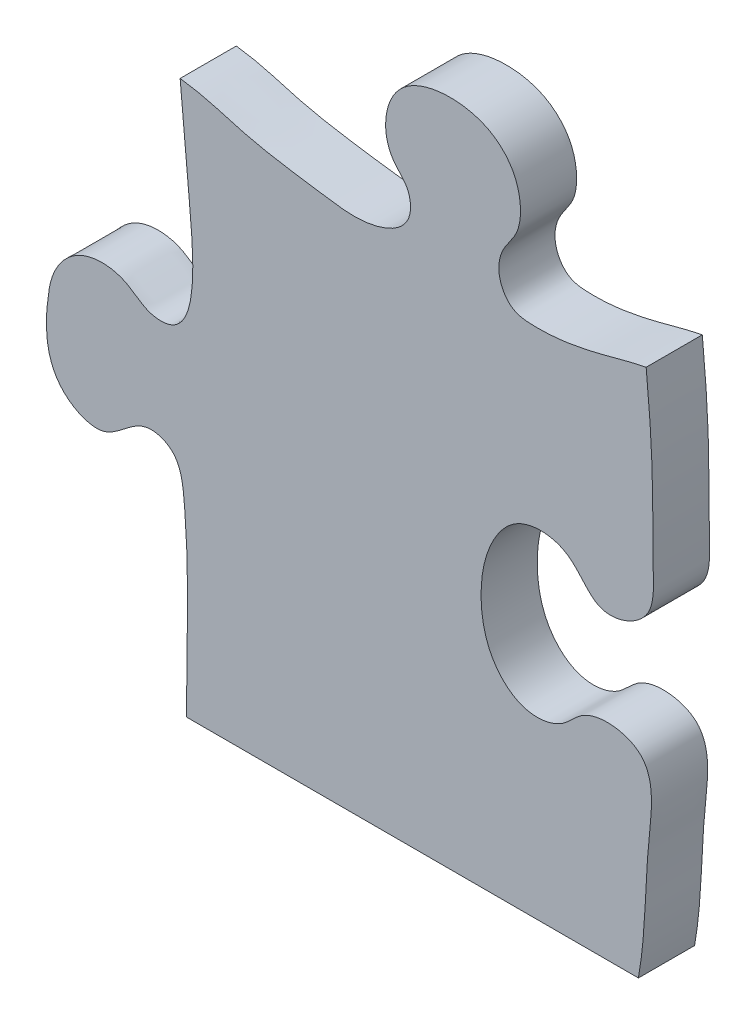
ISO-10303-21;
HEADER;
FILE_DESCRIPTION(('STEP AP214'),'2;1');
FILE_NAME('part.step','',(''),(''),'','','');
FILE_SCHEMA(('AUTOMOTIVE_DESIGN { 1 0 10303 214 1 1 1 1 }'));
ENDSEC;
DATA;
#1=APPLICATION_CONTEXT('core data for automotive mechanical design processes');
#2=APPLICATION_PROTOCOL_DEFINITION('international standard','automotive_design',2000,#1);
#3=PRODUCT_CONTEXT('',#1,'mechanical');
#4=PRODUCT('Part','Part','',(#3));
#5=PRODUCT_RELATED_PRODUCT_CATEGORY('part','',(#4));
#6=PRODUCT_DEFINITION_FORMATION('','',#4);
#7=PRODUCT_DEFINITION_CONTEXT('part definition',#1,'design');
#8=PRODUCT_DEFINITION('design','',#6,#7);
#9=PRODUCT_DEFINITION_SHAPE('','',#8);
#10=(LENGTH_UNIT() NAMED_UNIT(*) SI_UNIT(.MILLI.,.METRE.));
#11=(NAMED_UNIT(*) PLANE_ANGLE_UNIT() SI_UNIT($,.RADIAN.));
#12=(NAMED_UNIT(*) SI_UNIT($,.STERADIAN.) SOLID_ANGLE_UNIT());
#13=UNCERTAINTY_MEASURE_WITH_UNIT(LENGTH_MEASURE(1.E-05),#10,'distance_accuracy_value','');
#14=(GEOMETRIC_REPRESENTATION_CONTEXT(3) GLOBAL_UNCERTAINTY_ASSIGNED_CONTEXT((#13)) GLOBAL_UNIT_ASSIGNED_CONTEXT((#10,
#11,#12)) REPRESENTATION_CONTEXT('',''));
#15=CARTESIAN_POINT('',(0.,0.,0.));
#16=DIRECTION('',(0.,0.,1.));
#17=DIRECTION('',(1.,0.,0.));
#18=AXIS2_PLACEMENT_3D('',#15,#16,#17);
#19=CARTESIAN_POINT('',(325.257058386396,356.,-0.00999999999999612));
#20=CARTESIAN_POINT('',(320.961162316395,345.029410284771,-0.00999999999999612));
#21=CARTESIAN_POINT('',(320.821863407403,330.111228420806,-0.00999999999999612));
#22=CARTESIAN_POINT('',(317.746642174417,310.708405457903,-0.00999999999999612));
#23=CARTESIAN_POINT('',(324.80874526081,302.068845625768,-0.00999999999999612));
#24=CARTESIAN_POINT('',(334.47949844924,301.092198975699,-0.00999999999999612));
#25=CARTESIAN_POINT('',(341.199385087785,308.405018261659,-0.00999999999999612));
#26=CARTESIAN_POINT('',(351.88918877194,310.104343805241,-0.00999999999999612));
#27=CARTESIAN_POINT('',(365.477229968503,308.551893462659,-0.00999999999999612));
#28=CARTESIAN_POINT('',(373.973100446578,293.452904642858,-0.00999999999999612));
#29=CARTESIAN_POINT('',(374.68177629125,275.222888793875,-0.00999999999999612));
#30=CARTESIAN_POINT('',(363.969524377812,260.217712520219,-0.00999999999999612));
#31=CARTESIAN_POINT('',(347.560929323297,258.00994019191,-0.00999999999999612));
#32=CARTESIAN_POINT('',(341.667769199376,269.318092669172,-0.00999999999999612));
#33=CARTESIAN_POINT('',(329.050646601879,268.591464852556,-0.00999999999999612));
#34=CARTESIAN_POINT('',(320.333215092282,258.695380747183,-0.00999999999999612));
#35=CARTESIAN_POINT('',(321.071783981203,237.536716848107,-0.00999999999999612));
#36=CARTESIAN_POINT('',(324.445641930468,214.63289279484,-0.00999999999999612));
#37=CARTESIAN_POINT('',(329.382935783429,185.164436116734,-0.00999999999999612));
#38=CARTESIAN_POINT('',(327.148862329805,151.381238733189,-0.00999999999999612));
#39=CARTESIAN_POINT('',(325.104399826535,122.782989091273,-0.00999999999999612));
#40=CARTESIAN_POINT('',(327.870971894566,95.9027200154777,-0.00999999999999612));
#41=CARTESIAN_POINT('',(342.142457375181,93.3383677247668,-0.00999999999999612));
#42=CARTESIAN_POINT('',(347.900573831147,101.981576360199,-0.00999999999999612));
#43=CARTESIAN_POINT('',(356.834615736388,107.765098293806,-0.00999999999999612));
#44=CARTESIAN_POINT('',(369.379527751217,108.600772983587,-0.00999999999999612));
#45=CARTESIAN_POINT('',(380.120269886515,95.9775166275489,-0.00999999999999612));
#46=CARTESIAN_POINT('',(380.578851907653,78.7451628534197,-0.00999999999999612));
#47=CARTESIAN_POINT('',(375.610818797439,61.7248962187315,-0.00999999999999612));
#48=CARTESIAN_POINT('',(363.715824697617,52.8157722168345,-0.00999999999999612));
#49=CARTESIAN_POINT('',(349.85984979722,55.1705340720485,-0.00999999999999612));
#50=CARTESIAN_POINT('',(346.945856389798,64.810819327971,-0.00999999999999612));
#51=CARTESIAN_POINT('',(338.689797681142,70.9897723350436,-0.00999999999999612));
#52=CARTESIAN_POINT('',(330.580353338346,62.4728514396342,-0.00999999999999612));
#53=CARTESIAN_POINT('',(328.928359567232,48.4436203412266,-0.00999999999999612));
#54=CARTESIAN_POINT('',(329.318852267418,30.6791591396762,-0.00999999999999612));
#55=CARTESIAN_POINT('',(330.266196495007,6.75725364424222,-0.00999999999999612));
#56=CARTESIAN_POINT('',(328.413221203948,-22.8156731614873,-0.00999999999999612));
#57=CARTESIAN_POINT('',(325.957403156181,-47.4645191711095,-0.00999999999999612));
#58=CARTESIAN_POINT('',(324.284943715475,-71.7282942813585,-0.00999999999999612));
#59=CARTESIAN_POINT('',(336.158184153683,-74.5800053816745,-0.00999999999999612));
#60=CARTESIAN_POINT('',(345.605596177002,-70.2479425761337,-0.00999999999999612));
#61=CARTESIAN_POINT('',(352.349142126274,-60.6528291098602,-0.00999999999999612));
#62=CARTESIAN_POINT('',(364.054661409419,-61.084248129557,-0.00999999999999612));
#63=CARTESIAN_POINT('',(376.894401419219,-65.7171784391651,-0.00999999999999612));
#64=CARTESIAN_POINT('',(383.833690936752,-81.7570856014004,-0.00999999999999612));
#65=CARTESIAN_POINT('',(380.385627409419,-99.5380411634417,-0.00999999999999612));
#66=CARTESIAN_POINT('',(369.163029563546,-108.064440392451,-0.00999999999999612));
#67=CARTESIAN_POINT('',(355.487733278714,-112.894616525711,-0.00999999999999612));
#68=CARTESIAN_POINT('',(345.56890588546,-106.804716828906,-0.00999999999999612));
#69=CARTESIAN_POINT('',(337.864154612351,-99.6791187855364,-0.00999999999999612));
#70=CARTESIAN_POINT('',(325.333875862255,-101.340144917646,-0.00999999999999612));
#71=CARTESIAN_POINT('',(326.442256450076,-127.027418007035,-0.00999999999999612));
#72=CARTESIAN_POINT('',(328.990782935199,-147.650339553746,-0.00999999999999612));
#73=CARTESIAN_POINT('',(331.889209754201,-175.720931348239,-0.00999999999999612));
#74=CARTESIAN_POINT('',(333.49389611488,-200.043501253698,-0.00999999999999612));
#75=CARTESIAN_POINT('',(333.062418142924,-222.75850264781,-0.00999999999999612));
#76=CARTESIAN_POINT('',(334.041200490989,-241.335918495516,-0.00999999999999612));
#77=CARTESIAN_POINT('',(324.292862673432,-248.82670983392,-0.00999999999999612));
#78=CARTESIAN_POINT('',(313.862264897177,-249.831348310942,-0.00999999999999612));
#79=CARTESIAN_POINT('',(308.055191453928,-242.821422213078,-0.00999999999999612));
#80=CARTESIAN_POINT('',(300.480173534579,-235.015509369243,-0.00999999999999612));
#81=CARTESIAN_POINT('',(285.021810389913,-234.387092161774,-0.00999999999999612));
#82=CARTESIAN_POINT('',(274.179995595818,-248.432983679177,-0.00999999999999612));
#83=CARTESIAN_POINT('',(270.871780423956,-265.971502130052,-0.00999999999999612));
#84=CARTESIAN_POINT('',(274.212392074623,-284.032454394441,-0.00999999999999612));
#85=CARTESIAN_POINT('',(287.225269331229,-295.05235393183,-0.00999999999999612));
#86=CARTESIAN_POINT('',(300.809811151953,-292.931473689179,-0.00999999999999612));
#87=CARTESIAN_POINT('',(307.364923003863,-284.321305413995,-0.00999999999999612));
#88=CARTESIAN_POINT('',(317.634904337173,-281.646810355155,-0.00999999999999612));
#89=CARTESIAN_POINT('',(335.194502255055,-286.515768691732,-0.00999999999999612));
#90=CARTESIAN_POINT('',(329.900008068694,-321.054322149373,-0.00999999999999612));
#91=CARTESIAN_POINT('',(330.939416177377,-339.80390498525,-0.00999999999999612));
#92=CARTESIAN_POINT('',(328.124742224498,-356.,-0.00999999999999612));
#93=B_SPLINE_CURVE_WITH_KNOTS('',3,(#19,#20,#21,#22,#23,#24,#25,#26,#27,#28,#29,#30,#31,#32,#33,
#34,#35,#36,#37,#38,#39,#40,#41,#42,#43,#44,#45,#46,#47,#48,#49,#50,#51,#52,#53,#54,#55,#56,#57,
#58,#59,#60,#61,#62,#63,#64,#65,#66,#67,#68,#69,#70,#71,#72,#73,#74,#75,#76,#77,#78,#79,#80,#81,
#82,#83,#84,#85,#86,#87,#88,#89,#90,#91,#92),.UNSPECIFIED.,.F.,.F.,(4,1,1,1,1,1,1,1,1,1,1,1,1,1,
1,1,1,1,1,1,1,1,1,1,1,1,1,1,1,1,1,1,1,1,1,1,1,1,1,1,1,1,1,1,1,1,1,1,1,1,1,1,1,1,1,1,1,1,1,1,1,1,
1,1,1,1,1,1,1,1,1,4),(0.,0.0294359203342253,0.0410015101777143,0.0482578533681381,
0.056156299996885,0.0628725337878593,0.0726761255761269,0.0834491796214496,0.0961628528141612,
0.113582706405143,0.1292026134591,0.140393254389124,0.149299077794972,0.1578234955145,
0.168702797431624,0.18034067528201,0.211171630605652,0.230177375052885,0.258218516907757,
0.297936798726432,0.310855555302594,0.319545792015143,0.327782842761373,0.335750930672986,
0.347377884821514,0.35651553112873,0.375682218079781,0.389966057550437,0.401463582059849,
0.411615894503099,0.420595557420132,0.426581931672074,0.43417370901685,0.444880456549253,
0.464136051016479,0.480140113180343,0.507902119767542,0.539252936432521,0.552990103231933,
0.558383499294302,0.567729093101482,0.578921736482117,0.586248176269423,0.596305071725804,
0.613504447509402,0.626237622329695,0.64117705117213,0.647978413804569,0.662971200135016,
0.667795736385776,0.675224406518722,0.689293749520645,0.721613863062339,0.73643728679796,
0.762019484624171,0.785031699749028,0.797726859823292,0.806664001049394,0.814473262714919,
0.822386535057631,0.828765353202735,0.842978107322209,0.855573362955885,0.871677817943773,
0.889062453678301,0.900888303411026,0.912516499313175,0.920249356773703,0.928039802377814,
0.939164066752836,0.961164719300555,1.),.UNSPECIFIED.);
#94=DIRECTION('',(0.,0.,1.));
#95=VECTOR('',#94,1.);
#96=SURFACE_OF_LINEAR_EXTRUSION('',#93,#95);
#97=CARTESIAN_POINT('',(325.257058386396,356.,20.));
#98=CARTESIAN_POINT('',(320.961162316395,345.029410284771,20.));
#99=CARTESIAN_POINT('',(320.821863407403,330.111228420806,20.));
#100=CARTESIAN_POINT('',(317.746642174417,310.708405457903,20.));
#101=CARTESIAN_POINT('',(324.80874526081,302.068845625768,20.));
#102=CARTESIAN_POINT('',(334.47949844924,301.092198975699,20.));
#103=CARTESIAN_POINT('',(341.199385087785,308.405018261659,20.));
#104=CARTESIAN_POINT('',(351.88918877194,310.104343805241,20.));
#105=CARTESIAN_POINT('',(365.477229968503,308.551893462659,20.));
#106=CARTESIAN_POINT('',(373.973100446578,293.452904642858,20.));
#107=CARTESIAN_POINT('',(374.68177629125,275.222888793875,20.));
#108=CARTESIAN_POINT('',(363.969524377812,260.217712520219,20.));
#109=CARTESIAN_POINT('',(347.560929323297,258.00994019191,20.));
#110=CARTESIAN_POINT('',(341.667769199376,269.318092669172,20.));
#111=CARTESIAN_POINT('',(329.050646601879,268.591464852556,20.));
#112=CARTESIAN_POINT('',(320.333215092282,258.695380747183,20.));
#113=CARTESIAN_POINT('',(321.071783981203,237.536716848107,20.));
#114=CARTESIAN_POINT('',(324.445641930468,214.63289279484,20.));
#115=CARTESIAN_POINT('',(329.382935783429,185.164436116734,20.));
#116=CARTESIAN_POINT('',(327.148862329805,151.381238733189,20.));
#117=CARTESIAN_POINT('',(325.104399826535,122.782989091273,20.));
#118=CARTESIAN_POINT('',(327.870971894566,95.9027200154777,20.));
#119=CARTESIAN_POINT('',(342.142457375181,93.3383677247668,20.));
#120=CARTESIAN_POINT('',(347.900573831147,101.981576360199,20.));
#121=CARTESIAN_POINT('',(356.834615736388,107.765098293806,20.));
#122=CARTESIAN_POINT('',(369.379527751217,108.600772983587,20.));
#123=CARTESIAN_POINT('',(380.120269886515,95.9775166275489,20.));
#124=CARTESIAN_POINT('',(380.578851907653,78.7451628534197,20.));
#125=CARTESIAN_POINT('',(375.610818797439,61.7248962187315,20.));
#126=CARTESIAN_POINT('',(363.715824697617,52.8157722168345,20.));
#127=CARTESIAN_POINT('',(349.85984979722,55.1705340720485,20.));
#128=CARTESIAN_POINT('',(346.945856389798,64.810819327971,20.));
#129=CARTESIAN_POINT('',(338.689797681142,70.9897723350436,20.));
#130=CARTESIAN_POINT('',(330.580353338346,62.4728514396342,20.));
#131=CARTESIAN_POINT('',(328.928359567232,48.4436203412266,20.));
#132=CARTESIAN_POINT('',(329.318852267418,30.6791591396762,20.));
#133=CARTESIAN_POINT('',(330.266196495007,6.75725364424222,20.));
#134=CARTESIAN_POINT('',(328.413221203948,-22.8156731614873,20.));
#135=CARTESIAN_POINT('',(325.957403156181,-47.4645191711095,20.));
#136=CARTESIAN_POINT('',(324.284943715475,-71.7282942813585,20.));
#137=CARTESIAN_POINT('',(336.158184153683,-74.5800053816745,20.));
#138=CARTESIAN_POINT('',(345.605596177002,-70.2479425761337,20.));
#139=CARTESIAN_POINT('',(352.349142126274,-60.6528291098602,20.));
#140=CARTESIAN_POINT('',(364.054661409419,-61.084248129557,20.));
#141=CARTESIAN_POINT('',(376.894401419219,-65.7171784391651,20.));
#142=CARTESIAN_POINT('',(383.833690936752,-81.7570856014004,20.));
#143=CARTESIAN_POINT('',(380.385627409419,-99.5380411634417,20.));
#144=CARTESIAN_POINT('',(369.163029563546,-108.064440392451,20.));
#145=CARTESIAN_POINT('',(355.487733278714,-112.894616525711,20.));
#146=CARTESIAN_POINT('',(345.56890588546,-106.804716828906,20.));
#147=CARTESIAN_POINT('',(337.864154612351,-99.6791187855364,20.));
#148=CARTESIAN_POINT('',(325.333875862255,-101.340144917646,20.));
#149=CARTESIAN_POINT('',(326.442256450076,-127.027418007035,20.));
#150=CARTESIAN_POINT('',(328.990782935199,-147.650339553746,20.));
#151=CARTESIAN_POINT('',(331.889209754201,-175.720931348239,20.));
#152=CARTESIAN_POINT('',(333.49389611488,-200.043501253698,20.));
#153=CARTESIAN_POINT('',(333.062418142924,-222.75850264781,20.));
#154=CARTESIAN_POINT('',(334.041200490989,-241.335918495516,20.));
#155=CARTESIAN_POINT('',(324.292862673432,-248.82670983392,20.));
#156=CARTESIAN_POINT('',(313.862264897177,-249.831348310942,20.));
#157=CARTESIAN_POINT('',(308.055191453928,-242.821422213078,20.));
#158=CARTESIAN_POINT('',(300.480173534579,-235.015509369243,20.));
#159=CARTESIAN_POINT('',(285.021810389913,-234.387092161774,20.));
#160=CARTESIAN_POINT('',(274.179995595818,-248.432983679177,20.));
#161=CARTESIAN_POINT('',(270.871780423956,-265.971502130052,20.));
#162=CARTESIAN_POINT('',(274.212392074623,-284.032454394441,20.));
#163=CARTESIAN_POINT('',(287.225269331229,-295.05235393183,20.));
#164=CARTESIAN_POINT('',(300.809811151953,-292.931473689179,20.));
#165=CARTESIAN_POINT('',(307.364923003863,-284.321305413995,20.));
#166=CARTESIAN_POINT('',(317.634904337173,-281.646810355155,20.));
#167=CARTESIAN_POINT('',(335.194502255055,-286.515768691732,20.));
#168=CARTESIAN_POINT('',(329.900008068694,-321.054322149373,20.));
#169=CARTESIAN_POINT('',(330.939416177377,-339.80390498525,20.));
#170=CARTESIAN_POINT('',(328.124742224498,-356.,20.));
#171=B_SPLINE_CURVE_WITH_KNOTS('',3,(#97,#98,#99,#100,#101,#102,#103,#104,#105,#106,#107,#108,
#109,#110,#111,#112,#113,#114,#115,#116,#117,#118,#119,#120,#121,#122,#123,#124,#125,#126,#127,
#128,#129,#130,#131,#132,#133,#134,#135,#136,#137,#138,#139,#140,#141,#142,#143,#144,#145,#146,
#147,#148,#149,#150,#151,#152,#153,#154,#155,#156,#157,#158,#159,#160,#161,#162,#163,#164,#165,
#166,#167,#168,#169,#170),.UNSPECIFIED.,.F.,.F.,(4,1,1,1,1,1,1,1,1,1,1,1,1,1,1,1,1,1,1,1,1,1,1,
1,1,1,1,1,1,1,1,1,1,1,1,1,1,1,1,1,1,1,1,1,1,1,1,1,1,1,1,1,1,1,1,1,1,1,1,1,1,1,1,1,1,1,1,1,1,1,1,
4),(0.,0.0294359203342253,0.0410015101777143,0.0482578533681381,0.056156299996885,
0.0628725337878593,0.0726761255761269,0.0834491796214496,0.0961628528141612,0.113582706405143,
0.1292026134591,0.140393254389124,0.149299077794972,0.1578234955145,0.168702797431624,
0.18034067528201,0.211171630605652,0.230177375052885,0.258218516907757,0.297936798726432,
0.310855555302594,0.319545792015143,0.327782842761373,0.335750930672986,0.347377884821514,
0.35651553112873,0.375682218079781,0.389966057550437,0.401463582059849,0.411615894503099,
0.420595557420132,0.426581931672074,0.43417370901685,0.444880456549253,0.464136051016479,
0.480140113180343,0.507902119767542,0.539252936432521,0.552990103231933,0.558383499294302,
0.567729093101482,0.578921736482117,0.586248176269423,0.596305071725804,0.613504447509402,
0.626237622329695,0.64117705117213,0.647978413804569,0.662971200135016,0.667795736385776,
0.675224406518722,0.689293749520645,0.721613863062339,0.73643728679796,0.762019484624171,
0.785031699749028,0.797726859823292,0.806664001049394,0.814473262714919,0.822386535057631,
0.828765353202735,0.842978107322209,0.855573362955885,0.871677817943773,0.889062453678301,
0.900888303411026,0.912516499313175,0.920249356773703,0.928039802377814,0.939164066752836,
0.961164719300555,1.),.UNSPECIFIED.);
#172=CARTESIAN_POINT('',(330.882415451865,-166.22555796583,20.));
#173=VERTEX_POINT('',#172);
#174=CARTESIAN_POINT('',(328.124742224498,-356.,20.));
#175=VERTEX_POINT('',#174);
#176=EDGE_CURVE('E43',#173,#175,#171,.T.);
#177=ORIENTED_EDGE('',*,*,#176,.T.);
#178=DIRECTION('',(0.,0.,1.));
#179=VECTOR('',#178,1.);
#180=CARTESIAN_POINT('',(328.124742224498,-356.,-0.00999999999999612));
#181=LINE('',#180,#179);
#182=CARTESIAN_POINT('',(328.124742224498,-356.,0.));
#183=VERTEX_POINT('',#182);
#184=EDGE_CURVE('E85',#183,#175,#181,.T.);
#185=ORIENTED_EDGE('',*,*,#184,.F.);
#186=CARTESIAN_POINT('',(325.257058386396,356.,0.));
#187=CARTESIAN_POINT('',(320.961162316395,345.029410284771,0.));
#188=CARTESIAN_POINT('',(320.821863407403,330.111228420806,0.));
#189=CARTESIAN_POINT('',(317.746642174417,310.708405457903,0.));
#190=CARTESIAN_POINT('',(324.80874526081,302.068845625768,0.));
#191=CARTESIAN_POINT('',(334.47949844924,301.092198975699,0.));
#192=CARTESIAN_POINT('',(341.199385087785,308.405018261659,0.));
#193=CARTESIAN_POINT('',(351.88918877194,310.104343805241,0.));
#194=CARTESIAN_POINT('',(365.477229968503,308.551893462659,0.));
#195=CARTESIAN_POINT('',(373.973100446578,293.452904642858,0.));
#196=CARTESIAN_POINT('',(374.68177629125,275.222888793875,0.));
#197=CARTESIAN_POINT('',(363.969524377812,260.217712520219,0.));
#198=CARTESIAN_POINT('',(347.560929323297,258.00994019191,0.));
#199=CARTESIAN_POINT('',(341.667769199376,269.318092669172,0.));
#200=CARTESIAN_POINT('',(329.050646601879,268.591464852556,0.));
#201=CARTESIAN_POINT('',(320.333215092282,258.695380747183,0.));
#202=CARTESIAN_POINT('',(321.071783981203,237.536716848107,0.));
#203=CARTESIAN_POINT('',(324.445641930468,214.63289279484,0.));
#204=CARTESIAN_POINT('',(329.382935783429,185.164436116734,0.));
#205=CARTESIAN_POINT('',(327.148862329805,151.381238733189,0.));
#206=CARTESIAN_POINT('',(325.104399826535,122.782989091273,0.));
#207=CARTESIAN_POINT('',(327.870971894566,95.9027200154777,0.));
#208=CARTESIAN_POINT('',(342.142457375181,93.3383677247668,0.));
#209=CARTESIAN_POINT('',(347.900573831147,101.981576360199,0.));
#210=CARTESIAN_POINT('',(356.834615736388,107.765098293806,0.));
#211=CARTESIAN_POINT('',(369.379527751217,108.600772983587,0.));
#212=CARTESIAN_POINT('',(380.120269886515,95.9775166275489,0.));
#213=CARTESIAN_POINT('',(380.578851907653,78.7451628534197,0.));
#214=CARTESIAN_POINT('',(375.610818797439,61.7248962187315,0.));
#215=CARTESIAN_POINT('',(363.715824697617,52.8157722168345,0.));
#216=CARTESIAN_POINT('',(349.85984979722,55.1705340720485,0.));
#217=CARTESIAN_POINT('',(346.945856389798,64.810819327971,0.));
#218=CARTESIAN_POINT('',(338.689797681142,70.9897723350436,0.));
#219=CARTESIAN_POINT('',(330.580353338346,62.4728514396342,0.));
#220=CARTESIAN_POINT('',(328.928359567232,48.4436203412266,0.));
#221=CARTESIAN_POINT('',(329.318852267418,30.6791591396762,0.));
#222=CARTESIAN_POINT('',(330.266196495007,6.75725364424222,0.));
#223=CARTESIAN_POINT('',(328.413221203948,-22.8156731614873,0.));
#224=CARTESIAN_POINT('',(325.957403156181,-47.4645191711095,0.));
#225=CARTESIAN_POINT('',(324.284943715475,-71.7282942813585,0.));
#226=CARTESIAN_POINT('',(336.158184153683,-74.5800053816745,0.));
#227=CARTESIAN_POINT('',(345.605596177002,-70.2479425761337,0.));
#228=CARTESIAN_POINT('',(352.349142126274,-60.6528291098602,0.));
#229=CARTESIAN_POINT('',(364.054661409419,-61.084248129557,0.));
#230=CARTESIAN_POINT('',(376.894401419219,-65.7171784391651,0.));
#231=CARTESIAN_POINT('',(383.833690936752,-81.7570856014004,0.));
#232=CARTESIAN_POINT('',(380.385627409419,-99.5380411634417,0.));
#233=CARTESIAN_POINT('',(369.163029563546,-108.064440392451,0.));
#234=CARTESIAN_POINT('',(355.487733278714,-112.894616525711,0.));
#235=CARTESIAN_POINT('',(345.56890588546,-106.804716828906,0.));
#236=CARTESIAN_POINT('',(337.864154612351,-99.6791187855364,0.));
#237=CARTESIAN_POINT('',(325.333875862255,-101.340144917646,0.));
#238=CARTESIAN_POINT('',(326.442256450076,-127.027418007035,0.));
#239=CARTESIAN_POINT('',(328.990782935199,-147.650339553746,0.));
#240=CARTESIAN_POINT('',(331.889209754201,-175.720931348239,0.));
#241=CARTESIAN_POINT('',(333.49389611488,-200.043501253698,0.));
#242=CARTESIAN_POINT('',(333.062418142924,-222.75850264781,0.));
#243=CARTESIAN_POINT('',(334.041200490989,-241.335918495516,0.));
#244=CARTESIAN_POINT('',(324.292862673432,-248.82670983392,0.));
#245=CARTESIAN_POINT('',(313.862264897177,-249.831348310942,0.));
#246=CARTESIAN_POINT('',(308.055191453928,-242.821422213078,0.));
#247=CARTESIAN_POINT('',(300.480173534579,-235.015509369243,0.));
#248=CARTESIAN_POINT('',(285.021810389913,-234.387092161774,0.));
#249=CARTESIAN_POINT('',(274.179995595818,-248.432983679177,0.));
#250=CARTESIAN_POINT('',(270.871780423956,-265.971502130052,0.));
#251=CARTESIAN_POINT('',(274.212392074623,-284.032454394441,0.));
#252=CARTESIAN_POINT('',(287.225269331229,-295.05235393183,0.));
#253=CARTESIAN_POINT('',(300.809811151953,-292.931473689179,0.));
#254=CARTESIAN_POINT('',(307.364923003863,-284.321305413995,0.));
#255=CARTESIAN_POINT('',(317.634904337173,-281.646810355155,0.));
#256=CARTESIAN_POINT('',(335.194502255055,-286.515768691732,0.));
#257=CARTESIAN_POINT('',(329.900008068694,-321.054322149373,0.));
#258=CARTESIAN_POINT('',(330.939416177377,-339.80390498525,0.));
#259=CARTESIAN_POINT('',(328.124742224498,-356.,0.));
#260=B_SPLINE_CURVE_WITH_KNOTS('',3,(#186,#187,#188,#189,#190,#191,#192,#193,#194,#195,#196,
#197,#198,#199,#200,#201,#202,#203,#204,#205,#206,#207,#208,#209,#210,#211,#212,#213,#214,#215,
#216,#217,#218,#219,#220,#221,#222,#223,#224,#225,#226,#227,#228,#229,#230,#231,#232,#233,#234,
#235,#236,#237,#238,#239,#240,#241,#242,#243,#244,#245,#246,#247,#248,#249,#250,#251,#252,#253,
#254,#255,#256,#257,#258,#259),.UNSPECIFIED.,.F.,.F.,(4,1,1,1,1,1,1,1,1,1,1,1,1,1,1,1,1,1,1,1,1,
1,1,1,1,1,1,1,1,1,1,1,1,1,1,1,1,1,1,1,1,1,1,1,1,1,1,1,1,1,1,1,1,1,1,1,1,1,1,1,1,1,1,1,1,1,1,1,1,
1,1,4),(0.,0.0294359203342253,0.0410015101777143,0.0482578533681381,0.056156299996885,
0.0628725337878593,0.0726761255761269,0.0834491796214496,0.0961628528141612,0.113582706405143,
0.1292026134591,0.140393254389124,0.149299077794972,0.1578234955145,0.168702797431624,
0.18034067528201,0.211171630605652,0.230177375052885,0.258218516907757,0.297936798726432,
0.310855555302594,0.319545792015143,0.327782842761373,0.335750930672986,0.347377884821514,
0.35651553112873,0.375682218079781,0.389966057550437,0.401463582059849,0.411615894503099,
0.420595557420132,0.426581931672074,0.43417370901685,0.444880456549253,0.464136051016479,
0.480140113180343,0.507902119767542,0.539252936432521,0.552990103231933,0.558383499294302,
0.567729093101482,0.578921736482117,0.586248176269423,0.596305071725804,0.613504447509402,
0.626237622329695,0.64117705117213,0.647978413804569,0.662971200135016,0.667795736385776,
0.675224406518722,0.689293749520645,0.721613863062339,0.73643728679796,0.762019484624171,
0.785031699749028,0.797726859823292,0.806664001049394,0.814473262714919,0.822386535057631,
0.828765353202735,0.842978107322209,0.855573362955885,0.871677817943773,0.889062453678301,
0.900888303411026,0.912516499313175,0.920249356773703,0.928039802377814,0.939164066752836,
0.961164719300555,1.),.UNSPECIFIED.);
#261=CARTESIAN_POINT('',(330.882415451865,-166.22555796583,0.));
#262=VERTEX_POINT('',#261);
#263=EDGE_CURVE('E87',#262,#183,#260,.T.);
#264=ORIENTED_EDGE('',*,*,#263,.F.);
#265=DIRECTION('',(0.,0.,1.));
#266=VECTOR('',#265,1.);
#267=CARTESIAN_POINT('',(330.88241545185,-166.225557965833,-0.00999999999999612));
#268=LINE('',#267,#266);
#269=EDGE_CURVE('E77',#173,#262,#268,.F.);
#270=ORIENTED_EDGE('',*,*,#269,.F.);
#271=EDGE_LOOP('',(#177,#185,#264,#270));
#272=FACE_BOUND('',#271,.T.);
#273=ADVANCED_FACE('F34',(#272),#96,.F.);
#274=CARTESIAN_POINT('',(164.700455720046,356.,-0.00999999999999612));
#275=CARTESIAN_POINT('',(166.684488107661,335.198470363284,-0.00999999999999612));
#276=CARTESIAN_POINT('',(165.501961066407,316.54844325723,-0.00999999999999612));
#277=CARTESIAN_POINT('',(164.960386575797,287.97241381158,-0.00999999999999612));
#278=CARTESIAN_POINT('',(152.647306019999,285.390744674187,-0.00999999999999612));
#279=CARTESIAN_POINT('',(146.755099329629,295.454986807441,-0.00999999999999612));
#280=CARTESIAN_POINT('',(133.057911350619,298.241097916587,-0.00999999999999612));
#281=CARTESIAN_POINT('',(118.543117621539,289.096389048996,-0.00999999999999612));
#282=CARTESIAN_POINT('',(110.066069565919,270.786201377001,-0.00999999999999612));
#283=CARTESIAN_POINT('',(115.81886117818,249.01949577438,-0.00999999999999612));
#284=CARTESIAN_POINT('',(132.43055469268,243.861484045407,-0.00999999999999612));
#285=CARTESIAN_POINT('',(145.190771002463,247.721589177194,-0.00999999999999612));
#286=CARTESIAN_POINT('',(150.073688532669,259.755128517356,-0.00999999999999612));
#287=CARTESIAN_POINT('',(164.873456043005,258.011209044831,-0.00999999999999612));
#288=CARTESIAN_POINT('',(166.852874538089,244.914449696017,-0.00999999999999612));
#289=CARTESIAN_POINT('',(165.64887314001,235.496089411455,-0.00999999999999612));
#290=CARTESIAN_POINT('',(164.287273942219,218.693357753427,-0.00999999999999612));
#291=CARTESIAN_POINT('',(162.190296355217,197.368034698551,-0.00999999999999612));
#292=CARTESIAN_POINT('',(156.3242571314,163.987545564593,-0.00999999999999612));
#293=CARTESIAN_POINT('',(154.411282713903,133.17643128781,-0.00999999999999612));
#294=CARTESIAN_POINT('',(156.534624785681,107.79955112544,-0.00999999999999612));
#295=CARTESIAN_POINT('',(165.683431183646,96.7362595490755,-0.00999999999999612));
#296=CARTESIAN_POINT('',(175.741034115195,97.7165246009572,-0.00999999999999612));
#297=CARTESIAN_POINT('',(178.913476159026,105.433342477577,-0.00999999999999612));
#298=CARTESIAN_POINT('',(187.788546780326,107.088038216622,-0.00999999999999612));
#299=CARTESIAN_POINT('',(196.945345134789,104.662624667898,-0.00999999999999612));
#300=CARTESIAN_POINT('',(205.29981235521,92.5405980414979,-0.00999999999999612));
#301=CARTESIAN_POINT('',(205.41693478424,76.2178133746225,-0.00999999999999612));
#302=CARTESIAN_POINT('',(199.239540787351,59.8870096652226,-0.00999999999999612));
#303=CARTESIAN_POINT('',(186.871281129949,54.774238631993,-0.00999999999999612));
#304=CARTESIAN_POINT('',(176.156697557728,56.844920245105,-0.00999999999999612));
#305=CARTESIAN_POINT('',(170.099360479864,65.2771221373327,-0.00999999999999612));
#306=CARTESIAN_POINT('',(157.970826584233,62.7514417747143,-0.00999999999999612));
#307=CARTESIAN_POINT('',(154.504441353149,46.6972732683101,-0.00999999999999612));
#308=CARTESIAN_POINT('',(156.826886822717,28.5222575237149,-0.00999999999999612));
#309=CARTESIAN_POINT('',(160.951813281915,-0.904965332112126,-0.00999999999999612));
#310=CARTESIAN_POINT('',(160.817443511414,-23.2712614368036,-0.00999999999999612));
#311=CARTESIAN_POINT('',(159.515162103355,-48.5242453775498,-0.00999999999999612));
#312=CARTESIAN_POINT('',(159.855435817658,-66.2012023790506,-0.00999999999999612));
#313=CARTESIAN_POINT('',(174.098925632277,-64.1326131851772,-0.00999999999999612));
#314=CARTESIAN_POINT('',(178.558905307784,-57.1982656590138,-0.00999999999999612));
#315=CARTESIAN_POINT('',(189.170801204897,-53.4758485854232,-0.00999999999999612));
#316=CARTESIAN_POINT('',(204.121791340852,-56.9229006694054,-0.00999999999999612));
#317=CARTESIAN_POINT('',(214.382314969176,-74.3254117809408,-0.00999999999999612));
#318=CARTESIAN_POINT('',(212.434433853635,-94.56819618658,-0.00999999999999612));
#319=CARTESIAN_POINT('',(198.400882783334,-105.927100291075,-0.00999999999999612));
#320=CARTESIAN_POINT('',(183.864051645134,-103.318484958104,-0.00999999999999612));
#321=CARTESIAN_POINT('',(177.484460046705,-92.9196706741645,-0.00999999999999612));
#322=CARTESIAN_POINT('',(166.612136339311,-90.3684772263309,-0.00999999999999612));
#323=CARTESIAN_POINT('',(160.072685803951,-95.573386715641,-0.00999999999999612));
#324=CARTESIAN_POINT('',(159.605088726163,-111.518801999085,-0.00999999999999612));
#325=CARTESIAN_POINT('',(161.971531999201,-132.152629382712,-0.00999999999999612));
#326=CARTESIAN_POINT('',(165.531009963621,-165.300059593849,-0.00999999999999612));
#327=CARTESIAN_POINT('',(167.927544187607,-195.365052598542,-0.00999999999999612));
#328=CARTESIAN_POINT('',(172.57489134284,-240.687787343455,-0.00999999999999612));
#329=CARTESIAN_POINT('',(151.998880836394,-237.677540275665,-0.00999999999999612));
#330=CARTESIAN_POINT('',(144.556929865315,-230.426442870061,-0.00999999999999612));
#331=CARTESIAN_POINT('',(127.822205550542,-229.966972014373,-0.00999999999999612));
#332=CARTESIAN_POINT('',(119.338975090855,-241.300441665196,-0.00999999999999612));
#333=CARTESIAN_POINT('',(116.55363668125,-259.024274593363,-0.00999999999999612));
#334=CARTESIAN_POINT('',(116.920126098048,-276.665079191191,-0.00999999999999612));
#335=CARTESIAN_POINT('',(139.807593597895,-286.808161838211,-0.00999999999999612));
#336=CARTESIAN_POINT('',(149.426451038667,-271.120437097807,-0.00999999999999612));
#337=CARTESIAN_POINT('',(164.833722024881,-276.098774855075,-0.00999999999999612));
#338=CARTESIAN_POINT('',(167.534498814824,-298.611176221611,-0.00999999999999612));
#339=CARTESIAN_POINT('',(167.66539945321,-324.44648435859,-0.00999999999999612));
#340=CARTESIAN_POINT('',(167.206886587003,-345.801767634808,-0.00999999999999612));
#341=CARTESIAN_POINT('',(167.126415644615,-356.,-0.00999999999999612));
#342=B_SPLINE_CURVE_WITH_KNOTS('',3,(#274,#275,#276,#277,#278,#279,#280,#281,#282,#283,#284,
#285,#286,#287,#288,#289,#290,#291,#292,#293,#294,#295,#296,#297,#298,#299,#300,#301,#302,#303,
#304,#305,#306,#307,#308,#309,#310,#311,#312,#313,#314,#315,#316,#317,#318,#319,#320,#321,#322,
#323,#324,#325,#326,#327,#328,#329,#330,#331,#332,#333,#334,#335,#336,#337,#338,#339,#340,#341),
.UNSPECIFIED.,.F.,.F.,(4,1,1,1,1,1,1,1,1,1,1,1,1,1,1,1,1,1,1,1,1,1,1,1,1,1,1,1,1,1,1,1,1,1,1,1,
1,1,1,1,1,1,1,1,1,1,1,1,1,1,1,1,1,1,1,1,1,1,1,1,1,1,1,1,1,4),(0.,0.0528861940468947,
0.0611638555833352,0.0696733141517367,0.078438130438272,0.090018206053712,0.103675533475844,
0.122333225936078,0.142560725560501,0.155895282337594,0.165515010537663,0.176439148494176,
0.187171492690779,0.194785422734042,0.209132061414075,0.213814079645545,0.241605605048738,
0.267229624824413,0.306753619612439,0.326390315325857,0.335466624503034,0.342457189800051,
0.349640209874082,0.355564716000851,0.365339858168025,0.374043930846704,0.393709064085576,
0.408072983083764,0.418687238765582,0.427525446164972,0.43602306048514,0.444515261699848,
0.454494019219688,0.476412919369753,0.496275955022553,0.534624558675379,0.541144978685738,
0.561480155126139,0.567662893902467,0.574392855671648,0.583113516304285,0.596680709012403,
0.612912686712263,0.634082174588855,0.646626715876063,0.657822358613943,0.669754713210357,
0.678210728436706,0.685129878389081,0.689092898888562,0.71784093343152,0.747115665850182,
0.77522808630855,0.815611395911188,0.819725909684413,0.828398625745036,0.84335213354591,
0.85870373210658,0.863219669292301,0.888511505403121,0.901615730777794,0.918667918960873,
0.92637935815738,0.939283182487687,0.973955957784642,1.),.UNSPECIFIED.);
#343=DIRECTION('',(0.,0.,1.));
#344=VECTOR('',#343,1.);
#345=SURFACE_OF_LINEAR_EXTRUSION('',#342,#344);
#346=CARTESIAN_POINT('',(164.700455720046,356.,20.));
#347=CARTESIAN_POINT('',(166.684488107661,335.198470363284,20.));
#348=CARTESIAN_POINT('',(165.501961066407,316.54844325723,20.));
#349=CARTESIAN_POINT('',(164.960386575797,287.97241381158,20.));
#350=CARTESIAN_POINT('',(152.647306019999,285.390744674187,20.));
#351=CARTESIAN_POINT('',(146.755099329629,295.454986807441,20.));
#352=CARTESIAN_POINT('',(133.057911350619,298.241097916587,20.));
#353=CARTESIAN_POINT('',(118.543117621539,289.096389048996,20.));
#354=CARTESIAN_POINT('',(110.066069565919,270.786201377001,20.));
#355=CARTESIAN_POINT('',(115.81886117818,249.01949577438,20.));
#356=CARTESIAN_POINT('',(132.43055469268,243.861484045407,20.));
#357=CARTESIAN_POINT('',(145.190771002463,247.721589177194,20.));
#358=CARTESIAN_POINT('',(150.073688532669,259.755128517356,20.));
#359=CARTESIAN_POINT('',(164.873456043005,258.011209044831,20.));
#360=CARTESIAN_POINT('',(166.852874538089,244.914449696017,20.));
#361=CARTESIAN_POINT('',(165.64887314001,235.496089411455,20.));
#362=CARTESIAN_POINT('',(164.287273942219,218.693357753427,20.));
#363=CARTESIAN_POINT('',(162.190296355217,197.368034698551,20.));
#364=CARTESIAN_POINT('',(156.3242571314,163.987545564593,20.));
#365=CARTESIAN_POINT('',(154.411282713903,133.17643128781,20.));
#366=CARTESIAN_POINT('',(156.534624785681,107.79955112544,20.));
#367=CARTESIAN_POINT('',(165.683431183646,96.7362595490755,20.));
#368=CARTESIAN_POINT('',(175.741034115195,97.7165246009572,20.));
#369=CARTESIAN_POINT('',(178.913476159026,105.433342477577,20.));
#370=CARTESIAN_POINT('',(187.788546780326,107.088038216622,20.));
#371=CARTESIAN_POINT('',(196.945345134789,104.662624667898,20.));
#372=CARTESIAN_POINT('',(205.29981235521,92.5405980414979,20.));
#373=CARTESIAN_POINT('',(205.41693478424,76.2178133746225,20.));
#374=CARTESIAN_POINT('',(199.239540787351,59.8870096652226,20.));
#375=CARTESIAN_POINT('',(186.871281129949,54.774238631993,20.));
#376=CARTESIAN_POINT('',(176.156697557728,56.844920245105,20.));
#377=CARTESIAN_POINT('',(170.099360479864,65.2771221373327,20.));
#378=CARTESIAN_POINT('',(157.970826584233,62.7514417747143,20.));
#379=CARTESIAN_POINT('',(154.504441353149,46.6972732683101,20.));
#380=CARTESIAN_POINT('',(156.826886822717,28.5222575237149,20.));
#381=CARTESIAN_POINT('',(160.951813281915,-0.904965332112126,20.));
#382=CARTESIAN_POINT('',(160.817443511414,-23.2712614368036,20.));
#383=CARTESIAN_POINT('',(159.515162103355,-48.5242453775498,20.));
#384=CARTESIAN_POINT('',(159.855435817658,-66.2012023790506,20.));
#385=CARTESIAN_POINT('',(174.098925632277,-64.1326131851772,20.));
#386=CARTESIAN_POINT('',(178.558905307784,-57.1982656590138,20.));
#387=CARTESIAN_POINT('',(189.170801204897,-53.4758485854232,20.));
#388=CARTESIAN_POINT('',(204.121791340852,-56.9229006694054,20.));
#389=CARTESIAN_POINT('',(214.382314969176,-74.3254117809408,20.));
#390=CARTESIAN_POINT('',(212.434433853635,-94.56819618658,20.));
#391=CARTESIAN_POINT('',(198.400882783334,-105.927100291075,20.));
#392=CARTESIAN_POINT('',(183.864051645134,-103.318484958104,20.));
#393=CARTESIAN_POINT('',(177.484460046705,-92.9196706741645,20.));
#394=CARTESIAN_POINT('',(166.612136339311,-90.3684772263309,20.));
#395=CARTESIAN_POINT('',(160.072685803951,-95.573386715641,20.));
#396=CARTESIAN_POINT('',(159.605088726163,-111.518801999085,20.));
#397=CARTESIAN_POINT('',(161.971531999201,-132.152629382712,20.));
#398=CARTESIAN_POINT('',(165.531009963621,-165.300059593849,20.));
#399=CARTESIAN_POINT('',(167.927544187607,-195.365052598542,20.));
#400=CARTESIAN_POINT('',(172.57489134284,-240.687787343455,20.));
#401=CARTESIAN_POINT('',(151.998880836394,-237.677540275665,20.));
#402=CARTESIAN_POINT('',(144.556929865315,-230.426442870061,20.));
#403=CARTESIAN_POINT('',(127.822205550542,-229.966972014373,20.));
#404=CARTESIAN_POINT('',(119.338975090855,-241.300441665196,20.));
#405=CARTESIAN_POINT('',(116.55363668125,-259.024274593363,20.));
#406=CARTESIAN_POINT('',(116.920126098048,-276.665079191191,20.));
#407=CARTESIAN_POINT('',(139.807593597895,-286.808161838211,20.));
#408=CARTESIAN_POINT('',(149.426451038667,-271.120437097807,20.));
#409=CARTESIAN_POINT('',(164.833722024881,-276.098774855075,20.));
#410=CARTESIAN_POINT('',(167.534498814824,-298.611176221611,20.));
#411=CARTESIAN_POINT('',(167.66539945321,-324.44648435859,20.));
#412=CARTESIAN_POINT('',(167.206886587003,-345.801767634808,20.));
#413=CARTESIAN_POINT('',(167.126415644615,-356.,20.));
#414=B_SPLINE_CURVE_WITH_KNOTS('',3,(#346,#347,#348,#349,#350,#351,#352,#353,#354,#355,#356,
#357,#358,#359,#360,#361,#362,#363,#364,#365,#366,#367,#368,#369,#370,#371,#372,#373,#374,#375,
#376,#377,#378,#379,#380,#381,#382,#383,#384,#385,#386,#387,#388,#389,#390,#391,#392,#393,#394,
#395,#396,#397,#398,#399,#400,#401,#402,#403,#404,#405,#406,#407,#408,#409,#410,#411,#412,#413),
.UNSPECIFIED.,.F.,.F.,(4,1,1,1,1,1,1,1,1,1,1,1,1,1,1,1,1,1,1,1,1,1,1,1,1,1,1,1,1,1,1,1,1,1,1,1,
1,1,1,1,1,1,1,1,1,1,1,1,1,1,1,1,1,1,1,1,1,1,1,1,1,1,1,1,1,4),(0.,0.0528861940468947,
0.0611638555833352,0.0696733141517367,0.078438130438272,0.090018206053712,0.103675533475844,
0.122333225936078,0.142560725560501,0.155895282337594,0.165515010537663,0.176439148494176,
0.187171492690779,0.194785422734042,0.209132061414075,0.213814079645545,0.241605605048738,
0.267229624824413,0.306753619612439,0.326390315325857,0.335466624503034,0.342457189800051,
0.349640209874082,0.355564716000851,0.365339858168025,0.374043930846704,0.393709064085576,
0.408072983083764,0.418687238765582,0.427525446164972,0.43602306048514,0.444515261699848,
0.454494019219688,0.476412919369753,0.496275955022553,0.534624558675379,0.541144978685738,
0.561480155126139,0.567662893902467,0.574392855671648,0.583113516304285,0.596680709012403,
0.612912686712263,0.634082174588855,0.646626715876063,0.657822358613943,0.669754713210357,
0.678210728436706,0.685129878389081,0.689092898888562,0.71784093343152,0.747115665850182,
0.77522808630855,0.815611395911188,0.819725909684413,0.828398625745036,0.84335213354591,
0.85870373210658,0.863219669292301,0.888511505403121,0.901615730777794,0.918667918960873,
0.92637935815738,0.939283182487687,0.973955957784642,1.),.UNSPECIFIED.);
#415=CARTESIAN_POINT('',(164.89714626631,-160.138848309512,20.));
#416=VERTEX_POINT('',#415);
#417=CARTESIAN_POINT('',(167.126415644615,-356.,20.));
#418=VERTEX_POINT('',#417);
#419=EDGE_CURVE('E88',#416,#418,#414,.T.);
#420=ORIENTED_EDGE('',*,*,#419,.F.);
#421=DIRECTION('',(0.,0.,1.));
#422=VECTOR('',#421,1.);
#423=CARTESIAN_POINT('',(164.89714626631,-160.138848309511,-0.00999999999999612));
#424=LINE('',#423,#422);
#425=CARTESIAN_POINT('',(164.89714626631,-160.138848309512,0.));
#426=VERTEX_POINT('',#425);
#427=EDGE_CURVE('E38',#416,#426,#424,.F.);
#428=ORIENTED_EDGE('',*,*,#427,.T.);
#429=CARTESIAN_POINT('',(164.700455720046,356.,0.));
#430=CARTESIAN_POINT('',(166.684488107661,335.198470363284,0.));
#431=CARTESIAN_POINT('',(165.501961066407,316.54844325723,0.));
#432=CARTESIAN_POINT('',(164.960386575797,287.97241381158,0.));
#433=CARTESIAN_POINT('',(152.647306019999,285.390744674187,0.));
#434=CARTESIAN_POINT('',(146.755099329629,295.454986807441,0.));
#435=CARTESIAN_POINT('',(133.057911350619,298.241097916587,0.));
#436=CARTESIAN_POINT('',(118.543117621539,289.096389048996,0.));
#437=CARTESIAN_POINT('',(110.066069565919,270.786201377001,0.));
#438=CARTESIAN_POINT('',(115.81886117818,249.01949577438,0.));
#439=CARTESIAN_POINT('',(132.43055469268,243.861484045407,0.));
#440=CARTESIAN_POINT('',(145.190771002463,247.721589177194,0.));
#441=CARTESIAN_POINT('',(150.073688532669,259.755128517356,0.));
#442=CARTESIAN_POINT('',(164.873456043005,258.011209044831,0.));
#443=CARTESIAN_POINT('',(166.852874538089,244.914449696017,0.));
#444=CARTESIAN_POINT('',(165.64887314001,235.496089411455,0.));
#445=CARTESIAN_POINT('',(164.287273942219,218.693357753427,0.));
#446=CARTESIAN_POINT('',(162.190296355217,197.368034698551,0.));
#447=CARTESIAN_POINT('',(156.3242571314,163.987545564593,0.));
#448=CARTESIAN_POINT('',(154.411282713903,133.17643128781,0.));
#449=CARTESIAN_POINT('',(156.534624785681,107.79955112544,0.));
#450=CARTESIAN_POINT('',(165.683431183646,96.7362595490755,0.));
#451=CARTESIAN_POINT('',(175.741034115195,97.7165246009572,0.));
#452=CARTESIAN_POINT('',(178.913476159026,105.433342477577,0.));
#453=CARTESIAN_POINT('',(187.788546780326,107.088038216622,0.));
#454=CARTESIAN_POINT('',(196.945345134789,104.662624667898,0.));
#455=CARTESIAN_POINT('',(205.29981235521,92.5405980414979,0.));
#456=CARTESIAN_POINT('',(205.41693478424,76.2178133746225,0.));
#457=CARTESIAN_POINT('',(199.239540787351,59.8870096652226,0.));
#458=CARTESIAN_POINT('',(186.871281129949,54.774238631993,0.));
#459=CARTESIAN_POINT('',(176.156697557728,56.844920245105,0.));
#460=CARTESIAN_POINT('',(170.099360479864,65.2771221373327,0.));
#461=CARTESIAN_POINT('',(157.970826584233,62.7514417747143,0.));
#462=CARTESIAN_POINT('',(154.504441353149,46.6972732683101,0.));
#463=CARTESIAN_POINT('',(156.826886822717,28.5222575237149,0.));
#464=CARTESIAN_POINT('',(160.951813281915,-0.904965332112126,0.));
#465=CARTESIAN_POINT('',(160.817443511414,-23.2712614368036,0.));
#466=CARTESIAN_POINT('',(159.515162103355,-48.5242453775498,0.));
#467=CARTESIAN_POINT('',(159.855435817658,-66.2012023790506,0.));
#468=CARTESIAN_POINT('',(174.098925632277,-64.1326131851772,0.));
#469=CARTESIAN_POINT('',(178.558905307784,-57.1982656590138,0.));
#470=CARTESIAN_POINT('',(189.170801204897,-53.4758485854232,0.));
#471=CARTESIAN_POINT('',(204.121791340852,-56.9229006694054,0.));
#472=CARTESIAN_POINT('',(214.382314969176,-74.3254117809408,0.));
#473=CARTESIAN_POINT('',(212.434433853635,-94.56819618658,0.));
#474=CARTESIAN_POINT('',(198.400882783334,-105.927100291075,0.));
#475=CARTESIAN_POINT('',(183.864051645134,-103.318484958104,0.));
#476=CARTESIAN_POINT('',(177.484460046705,-92.9196706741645,0.));
#477=CARTESIAN_POINT('',(166.612136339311,-90.3684772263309,0.));
#478=CARTESIAN_POINT('',(160.072685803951,-95.573386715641,0.));
#479=CARTESIAN_POINT('',(159.605088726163,-111.518801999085,0.));
#480=CARTESIAN_POINT('',(161.971531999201,-132.152629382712,0.));
#481=CARTESIAN_POINT('',(165.531009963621,-165.300059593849,0.));
#482=CARTESIAN_POINT('',(167.927544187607,-195.365052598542,0.));
#483=CARTESIAN_POINT('',(172.57489134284,-240.687787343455,0.));
#484=CARTESIAN_POINT('',(151.998880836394,-237.677540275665,0.));
#485=CARTESIAN_POINT('',(144.556929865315,-230.426442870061,0.));
#486=CARTESIAN_POINT('',(127.822205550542,-229.966972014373,0.));
#487=CARTESIAN_POINT('',(119.338975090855,-241.300441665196,0.));
#488=CARTESIAN_POINT('',(116.55363668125,-259.024274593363,0.));
#489=CARTESIAN_POINT('',(116.920126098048,-276.665079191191,0.));
#490=CARTESIAN_POINT('',(139.807593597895,-286.808161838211,0.));
#491=CARTESIAN_POINT('',(149.426451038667,-271.120437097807,0.));
#492=CARTESIAN_POINT('',(164.833722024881,-276.098774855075,0.));
#493=CARTESIAN_POINT('',(167.534498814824,-298.611176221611,0.));
#494=CARTESIAN_POINT('',(167.66539945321,-324.44648435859,0.));
#495=CARTESIAN_POINT('',(167.206886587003,-345.801767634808,0.));
#496=CARTESIAN_POINT('',(167.126415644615,-356.,0.));
#497=B_SPLINE_CURVE_WITH_KNOTS('',3,(#429,#430,#431,#432,#433,#434,#435,#436,#437,#438,#439,
#440,#441,#442,#443,#444,#445,#446,#447,#448,#449,#450,#451,#452,#453,#454,#455,#456,#457,#458,
#459,#460,#461,#462,#463,#464,#465,#466,#467,#468,#469,#470,#471,#472,#473,#474,#475,#476,#477,
#478,#479,#480,#481,#482,#483,#484,#485,#486,#487,#488,#489,#490,#491,#492,#493,#494,#495,#496),
.UNSPECIFIED.,.F.,.F.,(4,1,1,1,1,1,1,1,1,1,1,1,1,1,1,1,1,1,1,1,1,1,1,1,1,1,1,1,1,1,1,1,1,1,1,1,
1,1,1,1,1,1,1,1,1,1,1,1,1,1,1,1,1,1,1,1,1,1,1,1,1,1,1,1,1,4),(0.,0.0528861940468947,
0.0611638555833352,0.0696733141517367,0.078438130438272,0.090018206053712,0.103675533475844,
0.122333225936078,0.142560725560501,0.155895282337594,0.165515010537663,0.176439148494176,
0.187171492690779,0.194785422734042,0.209132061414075,0.213814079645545,0.241605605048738,
0.267229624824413,0.306753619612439,0.326390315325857,0.335466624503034,0.342457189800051,
0.349640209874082,0.355564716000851,0.365339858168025,0.374043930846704,0.393709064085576,
0.408072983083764,0.418687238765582,0.427525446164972,0.43602306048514,0.444515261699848,
0.454494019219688,0.476412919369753,0.496275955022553,0.534624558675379,0.541144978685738,
0.561480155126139,0.567662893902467,0.574392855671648,0.583113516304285,0.596680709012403,
0.612912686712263,0.634082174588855,0.646626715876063,0.657822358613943,0.669754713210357,
0.678210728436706,0.685129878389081,0.689092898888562,0.71784093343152,0.747115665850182,
0.77522808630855,0.815611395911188,0.819725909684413,0.828398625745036,0.84335213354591,
0.85870373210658,0.863219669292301,0.888511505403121,0.901615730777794,0.918667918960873,
0.92637935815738,0.939283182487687,0.973955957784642,1.),.UNSPECIFIED.);
#498=CARTESIAN_POINT('',(167.126415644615,-356.,0.));
#499=VERTEX_POINT('',#498);
#500=EDGE_CURVE('E11',#426,#499,#497,.T.);
#501=ORIENTED_EDGE('',*,*,#500,.T.);
#502=DIRECTION('',(0.,0.,1.));
#503=VECTOR('',#502,1.);
#504=CARTESIAN_POINT('',(167.126415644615,-356.,-0.00999999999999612));
#505=LINE('',#504,#503);
#506=EDGE_CURVE('E134',#499,#418,#505,.T.);
#507=ORIENTED_EDGE('',*,*,#506,.T.);
#508=EDGE_LOOP('',(#420,#428,#501,#507));
#509=FACE_BOUND('',#508,.T.);
#510=ADVANCED_FACE('F126',(#509),#345,.T.);
#511=CARTESIAN_POINT('',(512.,-356.,20.));
#512=DIRECTION('',(0.,1.,0.));
#513=DIRECTION('',(-1.,0.,0.));
#514=AXIS2_PLACEMENT_3D('',#511,#512,#513);
#515=PLANE('',#514);
#516=ORIENTED_EDGE('',*,*,#506,.F.);
#517=DIRECTION('',(1.,0.,0.));
#518=VECTOR('',#517,1.);
#519=CARTESIAN_POINT('',(512.,-356.,0.));
#520=LINE('',#519,#518);
#521=EDGE_CURVE('E59',#499,#183,#520,.T.);
#522=ORIENTED_EDGE('',*,*,#521,.T.);
#523=ORIENTED_EDGE('',*,*,#184,.T.);
#524=DIRECTION('',(1.,0.,0.));
#525=VECTOR('',#524,1.);
#526=CARTESIAN_POINT('',(512.,-356.,20.));
#527=LINE('',#526,#525);
#528=EDGE_CURVE('E91',#418,#175,#527,.T.);
#529=ORIENTED_EDGE('',*,*,#528,.F.);
#530=EDGE_LOOP('',(#516,#522,#523,#529));
#531=FACE_BOUND('',#530,.T.);
#532=ADVANCED_FACE('F120',(#531),#515,.F.);
#533=CARTESIAN_POINT('',(-512.,-172.519287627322,-0.00999999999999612));
#534=CARTESIAN_POINT('',(-502.879283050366,-170.962470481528,-0.00999999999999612));
#535=CARTESIAN_POINT('',(-487.788222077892,-168.37828827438,-0.00999999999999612));
#536=CARTESIAN_POINT('',(-467.037528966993,-166.739801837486,-0.00999999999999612));
#537=CARTESIAN_POINT('',(-454.159365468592,-165.446436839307,-0.00999999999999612));
#538=CARTESIAN_POINT('',(-444.971534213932,-166.107812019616,-0.00999999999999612));
#539=CARTESIAN_POINT('',(-439.850321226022,-171.772015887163,-0.00999999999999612));
#540=CARTESIAN_POINT('',(-440.374957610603,-181.037323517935,-0.00999999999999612));
#541=CARTESIAN_POINT('',(-446.328241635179,-187.391856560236,-0.00999999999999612));
#542=CARTESIAN_POINT('',(-453.905227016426,-194.752671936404,-0.00999999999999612));
#543=CARTESIAN_POINT('',(-453.078389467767,-207.700641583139,-0.00999999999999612));
#544=CARTESIAN_POINT('',(-447.147625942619,-218.930001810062,-0.00999999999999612));
#545=CARTESIAN_POINT('',(-435.337181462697,-224.50074852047,-0.00999999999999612));
#546=CARTESIAN_POINT('',(-423.146614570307,-223.01936726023,-0.00999999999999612));
#547=CARTESIAN_POINT('',(-411.980938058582,-217.277205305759,-0.00999999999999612));
#548=CARTESIAN_POINT('',(-406.065466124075,-206.648631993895,-0.00999999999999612));
#549=CARTESIAN_POINT('',(-404.677696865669,-194.893000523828,-0.00999999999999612));
#550=CARTESIAN_POINT('',(-408.988751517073,-185.080089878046,-0.00999999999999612));
#551=CARTESIAN_POINT('',(-416.250714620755,-179.677092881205,-0.00999999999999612));
#552=CARTESIAN_POINT('',(-414.534960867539,-170.559036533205,-0.00999999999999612));
#553=CARTESIAN_POINT('',(-409.029101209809,-166.771377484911,-0.00999999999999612));
#554=CARTESIAN_POINT('',(-399.765557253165,-166.088529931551,-0.00999999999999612));
#555=CARTESIAN_POINT('',(-387.895154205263,-166.365956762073,-0.00999999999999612));
#556=CARTESIAN_POINT('',(-370.467023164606,-166.815486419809,-0.00999999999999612));
#557=CARTESIAN_POINT('',(-353.468929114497,-167.36046909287,-0.00999999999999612));
#558=CARTESIAN_POINT('',(-335.945481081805,-171.004639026,-0.00999999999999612));
#559=CARTESIAN_POINT('',(-314.642568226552,-174.308910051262,-0.00999999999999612));
#560=CARTESIAN_POINT('',(-295.191530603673,-175.373190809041,-0.00999999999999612));
#561=CARTESIAN_POINT('',(-279.655129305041,-174.532366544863,-0.00999999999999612));
#562=CARTESIAN_POINT('',(-272.871357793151,-169.661223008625,-0.00999999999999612));
#563=CARTESIAN_POINT('',(-269.507556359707,-161.549368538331,-0.00999999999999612));
#564=CARTESIAN_POINT('',(-275.843021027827,-154.65628056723,-0.00999999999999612));
#565=CARTESIAN_POINT('',(-280.95754914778,-144.902856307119,-0.00999999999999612));
#566=CARTESIAN_POINT('',(-276.534312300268,-130.977346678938,-0.00999999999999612));
#567=CARTESIAN_POINT('',(-261.937250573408,-125.579540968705,-0.00999999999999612));
#568=CARTESIAN_POINT('',(-247.663642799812,-124.917748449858,-0.00999999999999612));
#569=CARTESIAN_POINT('',(-234.462562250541,-132.547465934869,-0.00999999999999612));
#570=CARTESIAN_POINT('',(-231.429981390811,-144.191054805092,-0.00999999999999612));
#571=CARTESIAN_POINT('',(-232.066307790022,-154.613730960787,-0.00999999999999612));
#572=CARTESIAN_POINT('',(-238.05545254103,-160.208195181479,-0.00999999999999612));
#573=CARTESIAN_POINT('',(-239.725495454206,-167.504540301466,-0.00999999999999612));
#574=CARTESIAN_POINT('',(-236.616853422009,-176.333406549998,-0.00999999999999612));
#575=CARTESIAN_POINT('',(-223.934770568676,-178.282283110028,-0.00999999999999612));
#576=CARTESIAN_POINT('',(-211.556635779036,-176.87255281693,-0.00999999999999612));
#577=CARTESIAN_POINT('',(-197.283196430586,-172.884179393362,-0.00999999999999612));
#578=CARTESIAN_POINT('',(-182.605892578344,-171.15728588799,-0.00999999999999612));
#579=CARTESIAN_POINT('',(-164.840984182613,-173.659101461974,-0.00999999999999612));
#580=CARTESIAN_POINT('',(-147.945056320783,-175.383809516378,-0.00999999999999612));
#581=CARTESIAN_POINT('',(-131.023155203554,-175.064925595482,-0.00999999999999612));
#582=CARTESIAN_POINT('',(-118.854077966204,-171.888086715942,-0.00999999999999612));
#583=CARTESIAN_POINT('',(-110.251650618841,-164.015375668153,-0.00999999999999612));
#584=CARTESIAN_POINT('',(-112.366058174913,-152.74022327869,-0.00999999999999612));
#585=CARTESIAN_POINT('',(-124.029184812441,-149.21363367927,-0.00999999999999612));
#586=CARTESIAN_POINT('',(-130.728576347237,-135.686086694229,-0.00999999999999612));
#587=CARTESIAN_POINT('',(-127.173489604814,-119.738819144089,-0.00999999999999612));
#588=CARTESIAN_POINT('',(-112.643680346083,-109.612236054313,-0.00999999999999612));
#589=CARTESIAN_POINT('',(-97.8925044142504,-110.264465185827,-0.00999999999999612));
#590=CARTESIAN_POINT('',(-85.3244606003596,-114.886626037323,-0.00999999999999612));
#591=CARTESIAN_POINT('',(-77.7012738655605,-123.996273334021,-0.00999999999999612));
#592=CARTESIAN_POINT('',(-75.1871896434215,-136.082021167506,-0.00999999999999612));
#593=CARTESIAN_POINT('',(-83.4449300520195,-145.685757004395,-0.00999999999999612));
#594=CARTESIAN_POINT('',(-93.6696383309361,-152.57821138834,-0.00999999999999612));
#595=CARTESIAN_POINT('',(-93.6908124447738,-166.777041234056,-0.00999999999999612));
#596=CARTESIAN_POINT('',(-84.1667136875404,-170.982620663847,-0.00999999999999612));
#597=CARTESIAN_POINT('',(-77.6752461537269,-173.278649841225,-0.00999999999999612));
#598=CARTESIAN_POINT('',(-68.1506335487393,-173.35598232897,-0.00999999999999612));
#599=CARTESIAN_POINT('',(-50.9086392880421,-172.467654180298,-0.00999999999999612));
#600=CARTESIAN_POINT('',(-29.3703336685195,-168.255680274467,-0.00999999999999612));
#601=CARTESIAN_POINT('',(-5.85808978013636,-161.016855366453,-0.00999999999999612));
#602=CARTESIAN_POINT('',(10.8279950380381,-157.928962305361,-0.00999999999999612));
#603=CARTESIAN_POINT('',(25.2118575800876,-156.177147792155,-0.00999999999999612));
#604=CARTESIAN_POINT('',(33.2719504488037,-161.887778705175,-0.00999999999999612));
#605=CARTESIAN_POINT('',(35.8385918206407,-171.199049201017,-0.00999999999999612));
#606=CARTESIAN_POINT('',(29.9803253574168,-178.254603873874,-0.00999999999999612));
#607=CARTESIAN_POINT('',(25.4737691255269,-186.687205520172,-0.00999999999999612));
#608=CARTESIAN_POINT('',(28.9610561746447,-203.576557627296,-0.00999999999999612));
#609=CARTESIAN_POINT('',(48.123587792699,-210.569059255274,-0.00999999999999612));
#610=CARTESIAN_POINT('',(64.640055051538,-207.443077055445,-0.00999999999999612));
#611=CARTESIAN_POINT('',(74.3525428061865,-199.315206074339,-0.00999999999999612));
#612=CARTESIAN_POINT('',(75.7823175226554,-188.025012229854,-0.00999999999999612));
#613=CARTESIAN_POINT('',(70.2823025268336,-180.424725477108,-0.00999999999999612));
#614=CARTESIAN_POINT('',(64.0173174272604,-173.04354513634,-0.00999999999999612));
#615=CARTESIAN_POINT('',(71.5185276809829,-158.021609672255,-0.00999999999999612));
#616=CARTESIAN_POINT('',(93.5727320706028,-159.248655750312,-0.00999999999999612));
#617=CARTESIAN_POINT('',(113.740225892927,-158.313305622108,-0.00999999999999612));
#618=CARTESIAN_POINT('',(131.949907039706,-158.592164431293,-0.00999999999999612));
#619=CARTESIAN_POINT('',(148.33531025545,-158.585790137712,-0.00999999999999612));
#620=CARTESIAN_POINT('',(161.926831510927,-159.545351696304,-0.00999999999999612));
#621=CARTESIAN_POINT('',(175.071227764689,-161.773214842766,-0.00999999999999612));
#622=CARTESIAN_POINT('',(191.617950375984,-167.262045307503,-0.00999999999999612));
#623=CARTESIAN_POINT('',(211.099842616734,-169.750201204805,-0.00999999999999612));
#624=CARTESIAN_POINT('',(231.162897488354,-172.887375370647,-0.00999999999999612));
#625=CARTESIAN_POINT('',(248.004345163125,-166.961938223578,-0.00999999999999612));
#626=CARTESIAN_POINT('',(246.8159561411,-153.026737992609,-0.00999999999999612));
#627=CARTESIAN_POINT('',(239.480844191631,-147.244126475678,-0.00999999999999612));
#628=CARTESIAN_POINT('',(236.934105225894,-136.316213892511,-0.00999999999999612));
#629=CARTESIAN_POINT('',(242.714843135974,-119.925321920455,-0.00999999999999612));
#630=CARTESIAN_POINT('',(261.920814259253,-116.243910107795,-0.00999999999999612));
#631=CARTESIAN_POINT('',(276.115384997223,-120.8163533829,-0.00999999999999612));
#632=CARTESIAN_POINT('',(283.920063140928,-128.519918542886,-0.00999999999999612));
#633=CARTESIAN_POINT('',(286.731045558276,-138.27620491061,-0.00999999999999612));
#634=CARTESIAN_POINT('',(285.530131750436,-148.336399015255,-0.00999999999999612));
#635=CARTESIAN_POINT('',(279.231187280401,-154.989394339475,-0.00999999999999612));
#636=CARTESIAN_POINT('',(277.47424541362,-164.19805137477,-0.00999999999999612));
#637=CARTESIAN_POINT('',(282.318065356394,-172.951788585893,-0.00999999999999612));
#638=CARTESIAN_POINT('',(296.661024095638,-174.046241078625,-0.00999999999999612));
#639=CARTESIAN_POINT('',(312.407790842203,-171.220247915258,-0.00999999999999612));
#640=CARTESIAN_POINT('',(331.258502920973,-165.499354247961,-0.00999999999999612));
#641=CARTESIAN_POINT('',(349.515462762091,-164.109048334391,-0.00999999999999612));
#642=CARTESIAN_POINT('',(369.065560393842,-162.668121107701,-0.00999999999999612));
#643=CARTESIAN_POINT('',(383.300131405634,-163.956688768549,-0.00999999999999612));
#644=CARTESIAN_POINT('',(393.167029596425,-163.158367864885,-0.00999999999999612));
#645=CARTESIAN_POINT('',(398.987630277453,-166.389896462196,-0.00999999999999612));
#646=CARTESIAN_POINT('',(404.84494808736,-173.902135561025,-0.00999999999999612));
#647=CARTESIAN_POINT('',(403.877710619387,-184.83720633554,-0.00999999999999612));
#648=CARTESIAN_POINT('',(397.972595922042,-188.779997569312,-0.00999999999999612));
#649=CARTESIAN_POINT('',(391.418741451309,-195.180814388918,-0.00999999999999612));
#650=CARTESIAN_POINT('',(389.486866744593,-207.78576343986,-0.00999999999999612));
#651=CARTESIAN_POINT('',(398.568510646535,-219.719050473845,-0.00999999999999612));
#652=CARTESIAN_POINT('',(413.367098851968,-224.627522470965,-0.00999999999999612));
#653=CARTESIAN_POINT('',(430.645527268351,-225.349016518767,-0.00999999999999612));
#654=CARTESIAN_POINT('',(445.119633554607,-217.990655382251,-0.00999999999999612));
#655=CARTESIAN_POINT('',(450.39877091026,-206.645471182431,-0.00999999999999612));
#656=CARTESIAN_POINT('',(448.623596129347,-196.883477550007,-0.00999999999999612));
#657=CARTESIAN_POINT('',(441.485570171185,-190.93342380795,-0.00999999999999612));
#658=CARTESIAN_POINT('',(437.838155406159,-181.169971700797,-0.00999999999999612));
#659=CARTESIAN_POINT('',(439.616707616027,-168.611761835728,-0.00999999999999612));
#660=CARTESIAN_POINT('',(452.865547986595,-163.032695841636,-0.00999999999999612));
#661=CARTESIAN_POINT('',(467.117395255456,-164.448128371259,-0.00999999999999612));
#662=CARTESIAN_POINT('',(487.604647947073,-165.665160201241,-0.00999999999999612));
#663=CARTESIAN_POINT('',(502.403051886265,-168.291679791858,-0.00999999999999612));
#664=CARTESIAN_POINT('',(512.,-168.072880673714,-0.00999999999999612));
#665=B_SPLINE_CURVE_WITH_KNOTS('',3,(#533,#534,#535,#536,#537,#538,#539,#540,#541,#542,#543,
#544,#545,#546,#547,#548,#549,#550,#551,#552,#553,#554,#555,#556,#557,#558,#559,#560,#561,#562,
#563,#564,#565,#566,#567,#568,#569,#570,#571,#572,#573,#574,#575,#576,#577,#578,#579,#580,#581,
#582,#583,#584,#585,#586,#587,#588,#589,#590,#591,#592,#593,#594,#595,#596,#597,#598,#599,#600,
#601,#602,#603,#604,#605,#606,#607,#608,#609,#610,#611,#612,#613,#614,#615,#616,#617,#618,#619,
#620,#621,#622,#623,#624,#625,#626,#627,#628,#629,#630,#631,#632,#633,#634,#635,#636,#637,#638,
#639,#640,#641,#642,#643,#644,#645,#646,#647,#648,#649,#650,#651,#652,#653,#654,#655,#656,#657,
#658,#659,#660,#661,#662,#663,#664),.UNSPECIFIED.,.F.,.F.,(4,1,1,1,1,1,1,1,1,1,1,1,1,1,1,1,1,1,
1,1,1,1,1,1,1,1,1,1,1,1,1,1,1,1,1,1,1,1,1,1,1,1,1,1,1,1,1,1,1,1,1,1,1,1,1,1,1,1,1,1,1,1,1,1,1,1,
1,1,1,1,1,1,1,1,1,1,1,1,1,1,1,1,1,1,1,1,1,1,1,1,1,1,1,1,1,1,1,1,1,1,1,1,1,1,1,1,1,1,1,1,1,1,1,1,
1,1,1,1,1,1,1,1,1,1,1,1,1,1,1,4),(0.,0.0165769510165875,0.0274671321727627,0.0371464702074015,
0.0400980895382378,0.0433463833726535,0.0497073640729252,0.0544453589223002,0.0588139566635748,
0.0681101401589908,0.0747959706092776,0.0809546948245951,0.0901532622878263,0.095867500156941,
0.102811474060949,0.111015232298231,0.116106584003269,0.121579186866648,0.125543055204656,
0.130677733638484,0.132270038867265,0.141466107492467,0.152619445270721,0.163261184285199,
0.17192085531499,0.184637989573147,0.201793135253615,0.207148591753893,0.211794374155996,
0.216266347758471,0.220719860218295,0.227137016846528,0.235715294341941,0.242716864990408,
0.253632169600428,0.260665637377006,0.267939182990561,0.274072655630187,0.278241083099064,
0.281904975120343,0.287053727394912,0.29279991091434,0.302640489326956,0.309919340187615,
0.319192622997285,0.328902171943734,0.341927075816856,0.349651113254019,0.359095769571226,
0.364234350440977,0.368518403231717,0.376844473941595,0.383449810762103,0.39383324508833,
0.403172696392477,0.412747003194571,0.419192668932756,0.426662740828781,0.433256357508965,
0.43915987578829,0.447945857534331,0.454784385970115,0.459263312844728,0.465316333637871,
0.467037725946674,0.476477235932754,0.496011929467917,0.506346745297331,0.520318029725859,
0.527127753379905,0.530814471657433,0.537296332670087,0.541421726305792,0.546659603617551,
0.554071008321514,0.569060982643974,0.576942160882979,0.583891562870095,0.590293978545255,
0.59495110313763,0.600623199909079,0.605913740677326,0.620422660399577,0.634553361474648,
0.643799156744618,0.652762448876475,0.66399167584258,0.668151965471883,0.676618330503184,
0.695209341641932,0.702656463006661,0.714264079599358,0.719592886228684,0.724033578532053,
0.730384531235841,0.738333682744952,0.752555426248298,0.759343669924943,0.764844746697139,
0.771407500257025,0.776939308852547,0.782103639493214,0.787257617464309,0.792861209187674,
0.797464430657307,0.811466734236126,0.822004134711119,0.832486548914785,0.844241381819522,
0.856894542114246,0.858607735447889,0.861373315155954,0.868279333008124,0.874872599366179,
0.877877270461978,0.880642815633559,0.89130639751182,0.896526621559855,0.906482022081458,
0.917930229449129,0.927070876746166,0.933622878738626,0.939051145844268,0.943432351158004,
0.949734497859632,0.957214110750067,0.963224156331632,0.97316531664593,0.98286869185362,1.),.UNSPECIFIED.);
#666=DIRECTION('',(0.,0.,1.));
#667=VECTOR('',#666,1.);
#668=SURFACE_OF_LINEAR_EXTRUSION('',#665,#667);
#669=ORIENTED_EDGE('',*,*,#427,.F.);
#670=CARTESIAN_POINT('',(-512.,-172.519287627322,20.));
#671=CARTESIAN_POINT('',(-502.879283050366,-170.962470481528,20.));
#672=CARTESIAN_POINT('',(-487.788222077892,-168.37828827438,20.));
#673=CARTESIAN_POINT('',(-467.037528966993,-166.739801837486,20.));
#674=CARTESIAN_POINT('',(-454.159365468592,-165.446436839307,20.));
#675=CARTESIAN_POINT('',(-444.971534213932,-166.107812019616,20.));
#676=CARTESIAN_POINT('',(-439.850321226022,-171.772015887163,20.));
#677=CARTESIAN_POINT('',(-440.374957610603,-181.037323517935,20.));
#678=CARTESIAN_POINT('',(-446.328241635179,-187.391856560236,20.));
#679=CARTESIAN_POINT('',(-453.905227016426,-194.752671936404,20.));
#680=CARTESIAN_POINT('',(-453.078389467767,-207.700641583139,20.));
#681=CARTESIAN_POINT('',(-447.147625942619,-218.930001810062,20.));
#682=CARTESIAN_POINT('',(-435.337181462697,-224.50074852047,20.));
#683=CARTESIAN_POINT('',(-423.146614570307,-223.01936726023,20.));
#684=CARTESIAN_POINT('',(-411.980938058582,-217.277205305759,20.));
#685=CARTESIAN_POINT('',(-406.065466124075,-206.648631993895,20.));
#686=CARTESIAN_POINT('',(-404.677696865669,-194.893000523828,20.));
#687=CARTESIAN_POINT('',(-408.988751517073,-185.080089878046,20.));
#688=CARTESIAN_POINT('',(-416.250714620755,-179.677092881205,20.));
#689=CARTESIAN_POINT('',(-414.534960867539,-170.559036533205,20.));
#690=CARTESIAN_POINT('',(-409.029101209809,-166.771377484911,20.));
#691=CARTESIAN_POINT('',(-399.765557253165,-166.088529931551,20.));
#692=CARTESIAN_POINT('',(-387.895154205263,-166.365956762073,20.));
#693=CARTESIAN_POINT('',(-370.467023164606,-166.815486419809,20.));
#694=CARTESIAN_POINT('',(-353.468929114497,-167.36046909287,20.));
#695=CARTESIAN_POINT('',(-335.945481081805,-171.004639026,20.));
#696=CARTESIAN_POINT('',(-314.642568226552,-174.308910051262,20.));
#697=CARTESIAN_POINT('',(-295.191530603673,-175.373190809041,20.));
#698=CARTESIAN_POINT('',(-279.655129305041,-174.532366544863,20.));
#699=CARTESIAN_POINT('',(-272.871357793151,-169.661223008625,20.));
#700=CARTESIAN_POINT('',(-269.507556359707,-161.549368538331,20.));
#701=CARTESIAN_POINT('',(-275.843021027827,-154.65628056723,20.));
#702=CARTESIAN_POINT('',(-280.95754914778,-144.902856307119,20.));
#703=CARTESIAN_POINT('',(-276.534312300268,-130.977346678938,20.));
#704=CARTESIAN_POINT('',(-261.937250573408,-125.579540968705,20.));
#705=CARTESIAN_POINT('',(-247.663642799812,-124.917748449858,20.));
#706=CARTESIAN_POINT('',(-234.462562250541,-132.547465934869,20.));
#707=CARTESIAN_POINT('',(-231.429981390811,-144.191054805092,20.));
#708=CARTESIAN_POINT('',(-232.066307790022,-154.613730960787,20.));
#709=CARTESIAN_POINT('',(-238.05545254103,-160.208195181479,20.));
#710=CARTESIAN_POINT('',(-239.725495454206,-167.504540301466,20.));
#711=CARTESIAN_POINT('',(-236.616853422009,-176.333406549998,20.));
#712=CARTESIAN_POINT('',(-223.934770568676,-178.282283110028,20.));
#713=CARTESIAN_POINT('',(-211.556635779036,-176.87255281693,20.));
#714=CARTESIAN_POINT('',(-197.283196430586,-172.884179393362,20.));
#715=CARTESIAN_POINT('',(-182.605892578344,-171.15728588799,20.));
#716=CARTESIAN_POINT('',(-164.840984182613,-173.659101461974,20.));
#717=CARTESIAN_POINT('',(-147.945056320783,-175.383809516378,20.));
#718=CARTESIAN_POINT('',(-131.023155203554,-175.064925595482,20.));
#719=CARTESIAN_POINT('',(-118.854077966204,-171.888086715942,20.));
#720=CARTESIAN_POINT('',(-110.251650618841,-164.015375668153,20.));
#721=CARTESIAN_POINT('',(-112.366058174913,-152.74022327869,20.));
#722=CARTESIAN_POINT('',(-124.029184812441,-149.21363367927,20.));
#723=CARTESIAN_POINT('',(-130.728576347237,-135.686086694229,20.));
#724=CARTESIAN_POINT('',(-127.173489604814,-119.738819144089,20.));
#725=CARTESIAN_POINT('',(-112.643680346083,-109.612236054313,20.));
#726=CARTESIAN_POINT('',(-97.8925044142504,-110.264465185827,20.));
#727=CARTESIAN_POINT('',(-85.3244606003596,-114.886626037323,20.));
#728=CARTESIAN_POINT('',(-77.7012738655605,-123.996273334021,20.));
#729=CARTESIAN_POINT('',(-75.1871896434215,-136.082021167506,20.));
#730=CARTESIAN_POINT('',(-83.4449300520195,-145.685757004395,20.));
#731=CARTESIAN_POINT('',(-93.6696383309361,-152.57821138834,20.));
#732=CARTESIAN_POINT('',(-93.6908124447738,-166.777041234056,20.));
#733=CARTESIAN_POINT('',(-84.1667136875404,-170.982620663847,20.));
#734=CARTESIAN_POINT('',(-77.6752461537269,-173.278649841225,20.));
#735=CARTESIAN_POINT('',(-68.1506335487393,-173.35598232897,20.));
#736=CARTESIAN_POINT('',(-50.9086392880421,-172.467654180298,20.));
#737=CARTESIAN_POINT('',(-29.3703336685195,-168.255680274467,20.));
#738=CARTESIAN_POINT('',(-5.85808978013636,-161.016855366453,20.));
#739=CARTESIAN_POINT('',(10.8279950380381,-157.928962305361,20.));
#740=CARTESIAN_POINT('',(25.2118575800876,-156.177147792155,20.));
#741=CARTESIAN_POINT('',(33.2719504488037,-161.887778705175,20.));
#742=CARTESIAN_POINT('',(35.8385918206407,-171.199049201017,20.));
#743=CARTESIAN_POINT('',(29.9803253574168,-178.254603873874,20.));
#744=CARTESIAN_POINT('',(25.4737691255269,-186.687205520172,20.));
#745=CARTESIAN_POINT('',(28.9610561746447,-203.576557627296,20.));
#746=CARTESIAN_POINT('',(48.123587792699,-210.569059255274,20.));
#747=CARTESIAN_POINT('',(64.640055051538,-207.443077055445,20.));
#748=CARTESIAN_POINT('',(74.3525428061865,-199.315206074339,20.));
#749=CARTESIAN_POINT('',(75.7823175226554,-188.025012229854,20.));
#750=CARTESIAN_POINT('',(70.2823025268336,-180.424725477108,20.));
#751=CARTESIAN_POINT('',(64.0173174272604,-173.04354513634,20.));
#752=CARTESIAN_POINT('',(71.5185276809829,-158.021609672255,20.));
#753=CARTESIAN_POINT('',(93.5727320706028,-159.248655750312,20.));
#754=CARTESIAN_POINT('',(113.740225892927,-158.313305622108,20.));
#755=CARTESIAN_POINT('',(131.949907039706,-158.592164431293,20.));
#756=CARTESIAN_POINT('',(148.33531025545,-158.585790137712,20.));
#757=CARTESIAN_POINT('',(161.926831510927,-159.545351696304,20.));
#758=CARTESIAN_POINT('',(175.071227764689,-161.773214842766,20.));
#759=CARTESIAN_POINT('',(191.617950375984,-167.262045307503,20.));
#760=CARTESIAN_POINT('',(211.099842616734,-169.750201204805,20.));
#761=CARTESIAN_POINT('',(231.162897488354,-172.887375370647,20.));
#762=CARTESIAN_POINT('',(248.004345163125,-166.961938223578,20.));
#763=CARTESIAN_POINT('',(246.8159561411,-153.026737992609,20.));
#764=CARTESIAN_POINT('',(239.480844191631,-147.244126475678,20.));
#765=CARTESIAN_POINT('',(236.934105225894,-136.316213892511,20.));
#766=CARTESIAN_POINT('',(242.714843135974,-119.925321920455,20.));
#767=CARTESIAN_POINT('',(261.920814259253,-116.243910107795,20.));
#768=CARTESIAN_POINT('',(276.115384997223,-120.8163533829,20.));
#769=CARTESIAN_POINT('',(283.920063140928,-128.519918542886,20.));
#770=CARTESIAN_POINT('',(286.731045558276,-138.27620491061,20.));
#771=CARTESIAN_POINT('',(285.530131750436,-148.336399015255,20.));
#772=CARTESIAN_POINT('',(279.231187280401,-154.989394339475,20.));
#773=CARTESIAN_POINT('',(277.47424541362,-164.19805137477,20.));
#774=CARTESIAN_POINT('',(282.318065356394,-172.951788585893,20.));
#775=CARTESIAN_POINT('',(296.661024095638,-174.046241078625,20.));
#776=CARTESIAN_POINT('',(312.407790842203,-171.220247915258,20.));
#777=CARTESIAN_POINT('',(331.258502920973,-165.499354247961,20.));
#778=CARTESIAN_POINT('',(349.515462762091,-164.109048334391,20.));
#779=CARTESIAN_POINT('',(369.065560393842,-162.668121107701,20.));
#780=CARTESIAN_POINT('',(383.300131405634,-163.956688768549,20.));
#781=CARTESIAN_POINT('',(393.167029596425,-163.158367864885,20.));
#782=CARTESIAN_POINT('',(398.987630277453,-166.389896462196,20.));
#783=CARTESIAN_POINT('',(404.84494808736,-173.902135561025,20.));
#784=CARTESIAN_POINT('',(403.877710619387,-184.83720633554,20.));
#785=CARTESIAN_POINT('',(397.972595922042,-188.779997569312,20.));
#786=CARTESIAN_POINT('',(391.418741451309,-195.180814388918,20.));
#787=CARTESIAN_POINT('',(389.486866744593,-207.78576343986,20.));
#788=CARTESIAN_POINT('',(398.568510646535,-219.719050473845,20.));
#789=CARTESIAN_POINT('',(413.367098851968,-224.627522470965,20.));
#790=CARTESIAN_POINT('',(430.645527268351,-225.349016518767,20.));
#791=CARTESIAN_POINT('',(445.119633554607,-217.990655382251,20.));
#792=CARTESIAN_POINT('',(450.39877091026,-206.645471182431,20.));
#793=CARTESIAN_POINT('',(448.623596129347,-196.883477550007,20.));
#794=CARTESIAN_POINT('',(441.485570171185,-190.93342380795,20.));
#795=CARTESIAN_POINT('',(437.838155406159,-181.169971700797,20.));
#796=CARTESIAN_POINT('',(439.616707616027,-168.611761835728,20.));
#797=CARTESIAN_POINT('',(452.865547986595,-163.032695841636,20.));
#798=CARTESIAN_POINT('',(467.117395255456,-164.448128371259,20.));
#799=CARTESIAN_POINT('',(487.604647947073,-165.665160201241,20.));
#800=CARTESIAN_POINT('',(502.403051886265,-168.291679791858,20.));
#801=CARTESIAN_POINT('',(512.,-168.072880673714,20.));
#802=B_SPLINE_CURVE_WITH_KNOTS('',3,(#670,#671,#672,#673,#674,#675,#676,#677,#678,#679,#680,
#681,#682,#683,#684,#685,#686,#687,#688,#689,#690,#691,#692,#693,#694,#695,#696,#697,#698,#699,
#700,#701,#702,#703,#704,#705,#706,#707,#708,#709,#710,#711,#712,#713,#714,#715,#716,#717,#718,
#719,#720,#721,#722,#723,#724,#725,#726,#727,#728,#729,#730,#731,#732,#733,#734,#735,#736,#737,
#738,#739,#740,#741,#742,#743,#744,#745,#746,#747,#748,#749,#750,#751,#752,#753,#754,#755,#756,
#757,#758,#759,#760,#761,#762,#763,#764,#765,#766,#767,#768,#769,#770,#771,#772,#773,#774,#775,
#776,#777,#778,#779,#780,#781,#782,#783,#784,#785,#786,#787,#788,#789,#790,#791,#792,#793,#794,
#795,#796,#797,#798,#799,#800,#801),.UNSPECIFIED.,.F.,.F.,(4,1,1,1,1,1,1,1,1,1,1,1,1,1,1,1,1,1,
1,1,1,1,1,1,1,1,1,1,1,1,1,1,1,1,1,1,1,1,1,1,1,1,1,1,1,1,1,1,1,1,1,1,1,1,1,1,1,1,1,1,1,1,1,1,1,1,
1,1,1,1,1,1,1,1,1,1,1,1,1,1,1,1,1,1,1,1,1,1,1,1,1,1,1,1,1,1,1,1,1,1,1,1,1,1,1,1,1,1,1,1,1,1,1,1,
1,1,1,1,1,1,1,1,1,1,1,1,1,1,1,4),(0.,0.0165769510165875,0.0274671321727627,0.0371464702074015,
0.0400980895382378,0.0433463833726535,0.0497073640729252,0.0544453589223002,0.0588139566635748,
0.0681101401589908,0.0747959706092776,0.0809546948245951,0.0901532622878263,0.095867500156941,
0.102811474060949,0.111015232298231,0.116106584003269,0.121579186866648,0.125543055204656,
0.130677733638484,0.132270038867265,0.141466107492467,0.152619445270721,0.163261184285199,
0.17192085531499,0.184637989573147,0.201793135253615,0.207148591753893,0.211794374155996,
0.216266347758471,0.220719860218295,0.227137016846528,0.235715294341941,0.242716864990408,
0.253632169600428,0.260665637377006,0.267939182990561,0.274072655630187,0.278241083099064,
0.281904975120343,0.287053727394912,0.29279991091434,0.302640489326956,0.309919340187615,
0.319192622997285,0.328902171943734,0.341927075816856,0.349651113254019,0.359095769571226,
0.364234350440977,0.368518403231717,0.376844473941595,0.383449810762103,0.39383324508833,
0.403172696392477,0.412747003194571,0.419192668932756,0.426662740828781,0.433256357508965,
0.43915987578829,0.447945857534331,0.454784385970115,0.459263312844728,0.465316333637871,
0.467037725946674,0.476477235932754,0.496011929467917,0.506346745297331,0.520318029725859,
0.527127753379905,0.530814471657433,0.537296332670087,0.541421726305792,0.546659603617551,
0.554071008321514,0.569060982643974,0.576942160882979,0.583891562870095,0.590293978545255,
0.59495110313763,0.600623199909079,0.605913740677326,0.620422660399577,0.634553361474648,
0.643799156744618,0.652762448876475,0.66399167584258,0.668151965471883,0.676618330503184,
0.695209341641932,0.702656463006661,0.714264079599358,0.719592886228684,0.724033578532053,
0.730384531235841,0.738333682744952,0.752555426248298,0.759343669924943,0.764844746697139,
0.771407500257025,0.776939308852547,0.782103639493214,0.787257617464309,0.792861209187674,
0.797464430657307,0.811466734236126,0.822004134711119,0.832486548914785,0.844241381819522,
0.856894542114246,0.858607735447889,0.861373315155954,0.868279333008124,0.874872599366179,
0.877877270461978,0.880642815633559,0.89130639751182,0.896526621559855,0.906482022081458,
0.917930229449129,0.927070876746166,0.933622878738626,0.939051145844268,0.943432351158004,
0.949734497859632,0.957214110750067,0.963224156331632,0.97316531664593,0.98286869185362,1.),.UNSPECIFIED.);
#803=EDGE_CURVE('E81',#416,#173,#802,.T.);
#804=ORIENTED_EDGE('',*,*,#803,.T.);
#805=ORIENTED_EDGE('',*,*,#269,.T.);
#806=CARTESIAN_POINT('',(-512.,-172.519287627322,0.));
#807=CARTESIAN_POINT('',(-502.879283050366,-170.962470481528,0.));
#808=CARTESIAN_POINT('',(-487.788222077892,-168.37828827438,0.));
#809=CARTESIAN_POINT('',(-467.037528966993,-166.739801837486,0.));
#810=CARTESIAN_POINT('',(-454.159365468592,-165.446436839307,0.));
#811=CARTESIAN_POINT('',(-444.971534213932,-166.107812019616,0.));
#812=CARTESIAN_POINT('',(-439.850321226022,-171.772015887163,0.));
#813=CARTESIAN_POINT('',(-440.374957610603,-181.037323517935,0.));
#814=CARTESIAN_POINT('',(-446.328241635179,-187.391856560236,0.));
#815=CARTESIAN_POINT('',(-453.905227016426,-194.752671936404,0.));
#816=CARTESIAN_POINT('',(-453.078389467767,-207.700641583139,0.));
#817=CARTESIAN_POINT('',(-447.147625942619,-218.930001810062,0.));
#818=CARTESIAN_POINT('',(-435.337181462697,-224.50074852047,0.));
#819=CARTESIAN_POINT('',(-423.146614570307,-223.01936726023,0.));
#820=CARTESIAN_POINT('',(-411.980938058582,-217.277205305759,0.));
#821=CARTESIAN_POINT('',(-406.065466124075,-206.648631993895,0.));
#822=CARTESIAN_POINT('',(-404.677696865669,-194.893000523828,0.));
#823=CARTESIAN_POINT('',(-408.988751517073,-185.080089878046,0.));
#824=CARTESIAN_POINT('',(-416.250714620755,-179.677092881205,0.));
#825=CARTESIAN_POINT('',(-414.534960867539,-170.559036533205,0.));
#826=CARTESIAN_POINT('',(-409.029101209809,-166.771377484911,0.));
#827=CARTESIAN_POINT('',(-399.765557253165,-166.088529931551,0.));
#828=CARTESIAN_POINT('',(-387.895154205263,-166.365956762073,0.));
#829=CARTESIAN_POINT('',(-370.467023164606,-166.815486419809,0.));
#830=CARTESIAN_POINT('',(-353.468929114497,-167.36046909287,0.));
#831=CARTESIAN_POINT('',(-335.945481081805,-171.004639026,0.));
#832=CARTESIAN_POINT('',(-314.642568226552,-174.308910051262,0.));
#833=CARTESIAN_POINT('',(-295.191530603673,-175.373190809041,0.));
#834=CARTESIAN_POINT('',(-279.655129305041,-174.532366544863,0.));
#835=CARTESIAN_POINT('',(-272.871357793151,-169.661223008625,0.));
#836=CARTESIAN_POINT('',(-269.507556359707,-161.549368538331,0.));
#837=CARTESIAN_POINT('',(-275.843021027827,-154.65628056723,0.));
#838=CARTESIAN_POINT('',(-280.95754914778,-144.902856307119,0.));
#839=CARTESIAN_POINT('',(-276.534312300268,-130.977346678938,0.));
#840=CARTESIAN_POINT('',(-261.937250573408,-125.579540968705,0.));
#841=CARTESIAN_POINT('',(-247.663642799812,-124.917748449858,0.));
#842=CARTESIAN_POINT('',(-234.462562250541,-132.547465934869,0.));
#843=CARTESIAN_POINT('',(-231.429981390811,-144.191054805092,0.));
#844=CARTESIAN_POINT('',(-232.066307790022,-154.613730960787,0.));
#845=CARTESIAN_POINT('',(-238.05545254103,-160.208195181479,0.));
#846=CARTESIAN_POINT('',(-239.725495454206,-167.504540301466,0.));
#847=CARTESIAN_POINT('',(-236.616853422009,-176.333406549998,0.));
#848=CARTESIAN_POINT('',(-223.934770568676,-178.282283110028,0.));
#849=CARTESIAN_POINT('',(-211.556635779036,-176.87255281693,0.));
#850=CARTESIAN_POINT('',(-197.283196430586,-172.884179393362,0.));
#851=CARTESIAN_POINT('',(-182.605892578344,-171.15728588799,0.));
#852=CARTESIAN_POINT('',(-164.840984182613,-173.659101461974,0.));
#853=CARTESIAN_POINT('',(-147.945056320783,-175.383809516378,0.));
#854=CARTESIAN_POINT('',(-131.023155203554,-175.064925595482,0.));
#855=CARTESIAN_POINT('',(-118.854077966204,-171.888086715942,0.));
#856=CARTESIAN_POINT('',(-110.251650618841,-164.015375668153,0.));
#857=CARTESIAN_POINT('',(-112.366058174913,-152.74022327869,0.));
#858=CARTESIAN_POINT('',(-124.029184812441,-149.21363367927,0.));
#859=CARTESIAN_POINT('',(-130.728576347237,-135.686086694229,0.));
#860=CARTESIAN_POINT('',(-127.173489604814,-119.738819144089,0.));
#861=CARTESIAN_POINT('',(-112.643680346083,-109.612236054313,0.));
#862=CARTESIAN_POINT('',(-97.8925044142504,-110.264465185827,0.));
#863=CARTESIAN_POINT('',(-85.3244606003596,-114.886626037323,0.));
#864=CARTESIAN_POINT('',(-77.7012738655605,-123.996273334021,0.));
#865=CARTESIAN_POINT('',(-75.1871896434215,-136.082021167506,0.));
#866=CARTESIAN_POINT('',(-83.4449300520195,-145.685757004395,0.));
#867=CARTESIAN_POINT('',(-93.6696383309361,-152.57821138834,0.));
#868=CARTESIAN_POINT('',(-93.6908124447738,-166.777041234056,0.));
#869=CARTESIAN_POINT('',(-84.1667136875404,-170.982620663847,0.));
#870=CARTESIAN_POINT('',(-77.6752461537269,-173.278649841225,0.));
#871=CARTESIAN_POINT('',(-68.1506335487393,-173.35598232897,0.));
#872=CARTESIAN_POINT('',(-50.9086392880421,-172.467654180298,0.));
#873=CARTESIAN_POINT('',(-29.3703336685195,-168.255680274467,0.));
#874=CARTESIAN_POINT('',(-5.85808978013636,-161.016855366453,0.));
#875=CARTESIAN_POINT('',(10.8279950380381,-157.928962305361,0.));
#876=CARTESIAN_POINT('',(25.2118575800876,-156.177147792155,0.));
#877=CARTESIAN_POINT('',(33.2719504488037,-161.887778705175,0.));
#878=CARTESIAN_POINT('',(35.8385918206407,-171.199049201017,0.));
#879=CARTESIAN_POINT('',(29.9803253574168,-178.254603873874,0.));
#880=CARTESIAN_POINT('',(25.4737691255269,-186.687205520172,0.));
#881=CARTESIAN_POINT('',(28.9610561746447,-203.576557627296,0.));
#882=CARTESIAN_POINT('',(48.123587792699,-210.569059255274,0.));
#883=CARTESIAN_POINT('',(64.640055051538,-207.443077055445,0.));
#884=CARTESIAN_POINT('',(74.3525428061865,-199.315206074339,0.));
#885=CARTESIAN_POINT('',(75.7823175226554,-188.025012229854,0.));
#886=CARTESIAN_POINT('',(70.2823025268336,-180.424725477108,0.));
#887=CARTESIAN_POINT('',(64.0173174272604,-173.04354513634,0.));
#888=CARTESIAN_POINT('',(71.5185276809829,-158.021609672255,0.));
#889=CARTESIAN_POINT('',(93.5727320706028,-159.248655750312,0.));
#890=CARTESIAN_POINT('',(113.740225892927,-158.313305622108,0.));
#891=CARTESIAN_POINT('',(131.949907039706,-158.592164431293,0.));
#892=CARTESIAN_POINT('',(148.33531025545,-158.585790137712,0.));
#893=CARTESIAN_POINT('',(161.926831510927,-159.545351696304,0.));
#894=CARTESIAN_POINT('',(175.071227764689,-161.773214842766,0.));
#895=CARTESIAN_POINT('',(191.617950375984,-167.262045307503,0.));
#896=CARTESIAN_POINT('',(211.099842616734,-169.750201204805,0.));
#897=CARTESIAN_POINT('',(231.162897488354,-172.887375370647,0.));
#898=CARTESIAN_POINT('',(248.004345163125,-166.961938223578,0.));
#899=CARTESIAN_POINT('',(246.8159561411,-153.026737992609,0.));
#900=CARTESIAN_POINT('',(239.480844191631,-147.244126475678,0.));
#901=CARTESIAN_POINT('',(236.934105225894,-136.316213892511,0.));
#902=CARTESIAN_POINT('',(242.714843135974,-119.925321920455,0.));
#903=CARTESIAN_POINT('',(261.920814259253,-116.243910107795,0.));
#904=CARTESIAN_POINT('',(276.115384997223,-120.8163533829,0.));
#905=CARTESIAN_POINT('',(283.920063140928,-128.519918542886,0.));
#906=CARTESIAN_POINT('',(286.731045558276,-138.27620491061,0.));
#907=CARTESIAN_POINT('',(285.530131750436,-148.336399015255,0.));
#908=CARTESIAN_POINT('',(279.231187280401,-154.989394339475,0.));
#909=CARTESIAN_POINT('',(277.47424541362,-164.19805137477,0.));
#910=CARTESIAN_POINT('',(282.318065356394,-172.951788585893,0.));
#911=CARTESIAN_POINT('',(296.661024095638,-174.046241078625,0.));
#912=CARTESIAN_POINT('',(312.407790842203,-171.220247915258,0.));
#913=CARTESIAN_POINT('',(331.258502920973,-165.499354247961,0.));
#914=CARTESIAN_POINT('',(349.515462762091,-164.109048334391,0.));
#915=CARTESIAN_POINT('',(369.065560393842,-162.668121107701,0.));
#916=CARTESIAN_POINT('',(383.300131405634,-163.956688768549,0.));
#917=CARTESIAN_POINT('',(393.167029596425,-163.158367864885,0.));
#918=CARTESIAN_POINT('',(398.987630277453,-166.389896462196,0.));
#919=CARTESIAN_POINT('',(404.84494808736,-173.902135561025,0.));
#920=CARTESIAN_POINT('',(403.877710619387,-184.83720633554,0.));
#921=CARTESIAN_POINT('',(397.972595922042,-188.779997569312,0.));
#922=CARTESIAN_POINT('',(391.418741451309,-195.180814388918,0.));
#923=CARTESIAN_POINT('',(389.486866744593,-207.78576343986,0.));
#924=CARTESIAN_POINT('',(398.568510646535,-219.719050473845,0.));
#925=CARTESIAN_POINT('',(413.367098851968,-224.627522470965,0.));
#926=CARTESIAN_POINT('',(430.645527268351,-225.349016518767,0.));
#927=CARTESIAN_POINT('',(445.119633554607,-217.990655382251,0.));
#928=CARTESIAN_POINT('',(450.39877091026,-206.645471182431,0.));
#929=CARTESIAN_POINT('',(448.623596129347,-196.883477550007,0.));
#930=CARTESIAN_POINT('',(441.485570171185,-190.93342380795,0.));
#931=CARTESIAN_POINT('',(437.838155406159,-181.169971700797,0.));
#932=CARTESIAN_POINT('',(439.616707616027,-168.611761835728,0.));
#933=CARTESIAN_POINT('',(452.865547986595,-163.032695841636,0.));
#934=CARTESIAN_POINT('',(467.117395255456,-164.448128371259,0.));
#935=CARTESIAN_POINT('',(487.604647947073,-165.665160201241,0.));
#936=CARTESIAN_POINT('',(502.403051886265,-168.291679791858,0.));
#937=CARTESIAN_POINT('',(512.,-168.072880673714,0.));
#938=B_SPLINE_CURVE_WITH_KNOTS('',3,(#806,#807,#808,#809,#810,#811,#812,#813,#814,#815,#816,
#817,#818,#819,#820,#821,#822,#823,#824,#825,#826,#827,#828,#829,#830,#831,#832,#833,#834,#835,
#836,#837,#838,#839,#840,#841,#842,#843,#844,#845,#846,#847,#848,#849,#850,#851,#852,#853,#854,
#855,#856,#857,#858,#859,#860,#861,#862,#863,#864,#865,#866,#867,#868,#869,#870,#871,#872,#873,
#874,#875,#876,#877,#878,#879,#880,#881,#882,#883,#884,#885,#886,#887,#888,#889,#890,#891,#892,
#893,#894,#895,#896,#897,#898,#899,#900,#901,#902,#903,#904,#905,#906,#907,#908,#909,#910,#911,
#912,#913,#914,#915,#916,#917,#918,#919,#920,#921,#922,#923,#924,#925,#926,#927,#928,#929,#930,
#931,#932,#933,#934,#935,#936,#937),.UNSPECIFIED.,.F.,.F.,(4,1,1,1,1,1,1,1,1,1,1,1,1,1,1,1,1,1,
1,1,1,1,1,1,1,1,1,1,1,1,1,1,1,1,1,1,1,1,1,1,1,1,1,1,1,1,1,1,1,1,1,1,1,1,1,1,1,1,1,1,1,1,1,1,1,1,
1,1,1,1,1,1,1,1,1,1,1,1,1,1,1,1,1,1,1,1,1,1,1,1,1,1,1,1,1,1,1,1,1,1,1,1,1,1,1,1,1,1,1,1,1,1,1,1,
1,1,1,1,1,1,1,1,1,1,1,1,1,1,1,4),(0.,0.0165769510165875,0.0274671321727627,0.0371464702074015,
0.0400980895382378,0.0433463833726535,0.0497073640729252,0.0544453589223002,0.0588139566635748,
0.0681101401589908,0.0747959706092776,0.0809546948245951,0.0901532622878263,0.095867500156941,
0.102811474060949,0.111015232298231,0.116106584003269,0.121579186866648,0.125543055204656,
0.130677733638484,0.132270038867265,0.141466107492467,0.152619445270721,0.163261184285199,
0.17192085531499,0.184637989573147,0.201793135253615,0.207148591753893,0.211794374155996,
0.216266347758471,0.220719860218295,0.227137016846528,0.235715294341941,0.242716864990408,
0.253632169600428,0.260665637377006,0.267939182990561,0.274072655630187,0.278241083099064,
0.281904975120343,0.287053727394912,0.29279991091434,0.302640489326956,0.309919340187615,
0.319192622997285,0.328902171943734,0.341927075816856,0.349651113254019,0.359095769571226,
0.364234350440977,0.368518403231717,0.376844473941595,0.383449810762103,0.39383324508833,
0.403172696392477,0.412747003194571,0.419192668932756,0.426662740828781,0.433256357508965,
0.43915987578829,0.447945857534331,0.454784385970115,0.459263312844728,0.465316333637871,
0.467037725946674,0.476477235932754,0.496011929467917,0.506346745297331,0.520318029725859,
0.527127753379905,0.530814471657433,0.537296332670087,0.541421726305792,0.546659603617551,
0.554071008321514,0.569060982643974,0.576942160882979,0.583891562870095,0.590293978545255,
0.59495110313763,0.600623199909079,0.605913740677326,0.620422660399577,0.634553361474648,
0.643799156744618,0.652762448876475,0.66399167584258,0.668151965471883,0.676618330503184,
0.695209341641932,0.702656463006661,0.714264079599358,0.719592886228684,0.724033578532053,
0.730384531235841,0.738333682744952,0.752555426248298,0.759343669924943,0.764844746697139,
0.771407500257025,0.776939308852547,0.782103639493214,0.787257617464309,0.792861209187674,
0.797464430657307,0.811466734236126,0.822004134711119,0.832486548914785,0.844241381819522,
0.856894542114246,0.858607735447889,0.861373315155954,0.868279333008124,0.874872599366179,
0.877877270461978,0.880642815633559,0.89130639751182,0.896526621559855,0.906482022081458,
0.917930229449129,0.927070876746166,0.933622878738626,0.939051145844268,0.943432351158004,
0.949734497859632,0.957214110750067,0.963224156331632,0.97316531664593,0.98286869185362,1.),.UNSPECIFIED.);
#939=EDGE_CURVE('E51',#426,#262,#938,.T.);
#940=ORIENTED_EDGE('',*,*,#939,.F.);
#941=EDGE_LOOP('',(#669,#804,#805,#940));
#942=FACE_BOUND('',#941,.T.);
#943=ADVANCED_FACE('F79',(#942),#668,.F.);
#944=CARTESIAN_POINT('',(0.,0.,0.));
#945=DIRECTION('',(0.,0.,1.));
#946=DIRECTION('',(1.,0.,0.));
#947=AXIS2_PLACEMENT_3D('',#944,#945,#946);
#948=PLANE('',#947);
#949=ORIENTED_EDGE('',*,*,#500,.F.);
#950=ORIENTED_EDGE('',*,*,#939,.T.);
#951=ORIENTED_EDGE('',*,*,#263,.T.);
#952=ORIENTED_EDGE('',*,*,#521,.F.);
#953=EDGE_LOOP('',(#949,#950,#951,#952));
#954=FACE_BOUND('',#953,.T.);
#955=ADVANCED_FACE('F90',(#954),#948,.F.);
#956=CARTESIAN_POINT('',(0.,0.,20.));
#957=DIRECTION('',(0.,0.,1.));
#958=DIRECTION('',(1.,0.,0.));
#959=AXIS2_PLACEMENT_3D('',#956,#957,#958);
#960=PLANE('',#959);
#961=ORIENTED_EDGE('',*,*,#803,.F.);
#962=ORIENTED_EDGE('',*,*,#419,.T.);
#963=ORIENTED_EDGE('',*,*,#528,.T.);
#964=ORIENTED_EDGE('',*,*,#176,.F.);
#965=EDGE_LOOP('',(#961,#962,#963,#964));
#966=FACE_BOUND('',#965,.T.);
#967=ADVANCED_FACE('F123',(#966),#960,.T.);
#968=CLOSED_SHELL('',(#273,#510,#532,#943,#955,#967));
#969=MANIFOLD_SOLID_BREP('B2',#968);
#970=ADVANCED_BREP_SHAPE_REPRESENTATION('',(#18,#969),#14);
#971=SHAPE_DEFINITION_REPRESENTATION(#9,#970);
ENDSEC;
END-ISO-10303-21;
